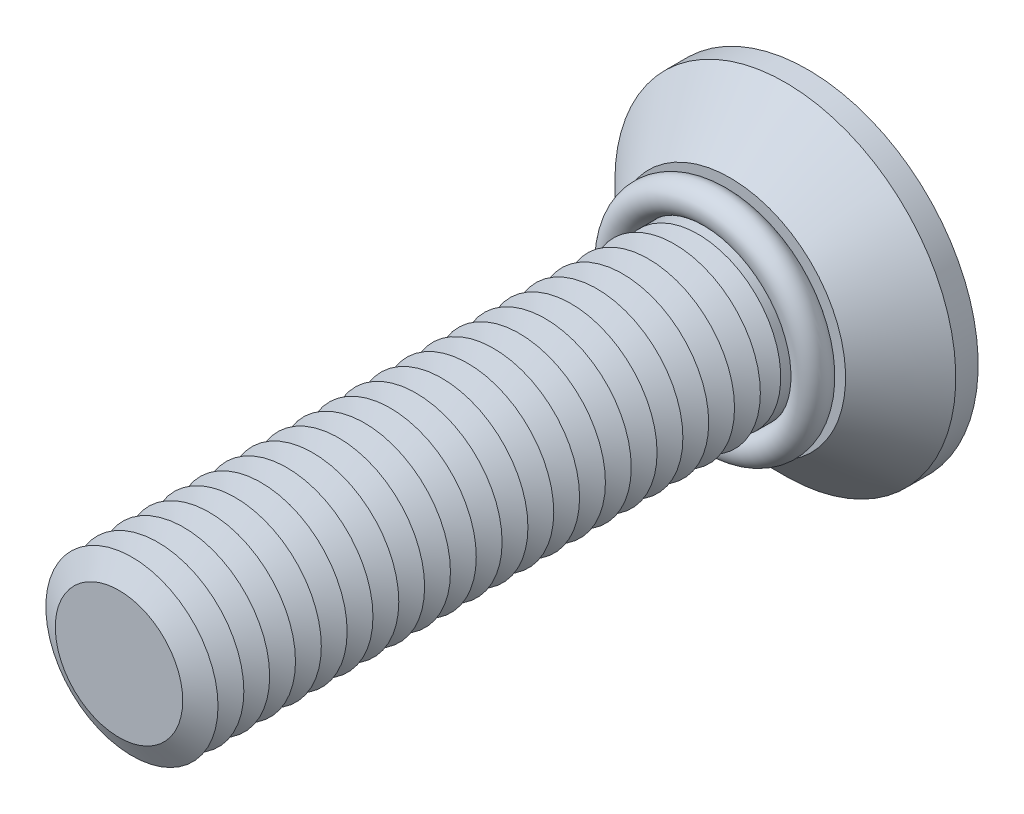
ISO-10303-21;
HEADER;
FILE_DESCRIPTION(('STEP AP214'),'2;1');
FILE_NAME('part.step','',(''),(''),'','','');
FILE_SCHEMA(('AUTOMOTIVE_DESIGN { 1 0 10303 214 1 1 1 1 }'));
ENDSEC;
DATA;
#1=APPLICATION_CONTEXT('core data for automotive mechanical design processes');
#2=APPLICATION_PROTOCOL_DEFINITION('international standard','automotive_design',2000,#1);
#3=PRODUCT_CONTEXT('',#1,'mechanical');
#4=PRODUCT('Part','Part','',(#3));
#5=PRODUCT_RELATED_PRODUCT_CATEGORY('part','',(#4));
#6=PRODUCT_DEFINITION_FORMATION('','',#4);
#7=PRODUCT_DEFINITION_CONTEXT('part definition',#1,'design');
#8=PRODUCT_DEFINITION('design','',#6,#7);
#9=PRODUCT_DEFINITION_SHAPE('','',#8);
#10=(LENGTH_UNIT() NAMED_UNIT(*) SI_UNIT(.MILLI.,.METRE.));
#11=(NAMED_UNIT(*) PLANE_ANGLE_UNIT() SI_UNIT($,.RADIAN.));
#12=(NAMED_UNIT(*) SI_UNIT($,.STERADIAN.) SOLID_ANGLE_UNIT());
#13=UNCERTAINTY_MEASURE_WITH_UNIT(LENGTH_MEASURE(1.E-05),#10,'distance_accuracy_value','');
#14=(GEOMETRIC_REPRESENTATION_CONTEXT(3) GLOBAL_UNCERTAINTY_ASSIGNED_CONTEXT((#13)) GLOBAL_UNIT_ASSIGNED_CONTEXT((#10,
#11,#12)) REPRESENTATION_CONTEXT('',''));
#15=CARTESIAN_POINT('',(0.,0.,0.));
#16=DIRECTION('',(0.,0.,1.));
#17=DIRECTION('',(1.,0.,0.));
#18=AXIS2_PLACEMENT_3D('',#15,#16,#17);
#19=CARTESIAN_POINT('',(0.,0.,5.39999999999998));
#20=DIRECTION('',(0.,0.,1.));
#21=DIRECTION('',(1.,0.,0.));
#22=AXIS2_PLACEMENT_3D('',#19,#20,#21);
#23=TOROIDAL_SURFACE('',#22,5.7,0.9);
#24=CARTESIAN_POINT('',(0.,5.7,5.39999999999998));
#25=DIRECTION('',(1.,0.,0.));
#26=DIRECTION('',(0.,0.,-1.));
#27=AXIS2_PLACEMENT_3D('',#24,#25,#26);
#28=CIRCLE('',#27,0.9);
#29=CARTESIAN_POINT('',(0.,6.6,5.39999999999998));
#30=VERTEX_POINT('',#29);
#31=EDGE_CURVE('P0_E10',#30,#30,#28,.T.);
#32=CARTESIAN_POINT('',(0.,0.,5.39999999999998));
#33=DIRECTION('',(0.,0.,1.));
#34=DIRECTION('',(1.,0.,0.));
#35=AXIS2_PLACEMENT_3D('',#32,#33,#34);
#36=CIRCLE('',#35,6.6);
#37=EDGE_CURVE('',#30,#30,#36,.T.);
#38=ORIENTED_EDGE('',*,*,#31,.F.);
#39=ORIENTED_EDGE('',*,*,#31,.T.);
#40=ORIENTED_EDGE('',*,*,#37,.T.);
#41=ORIENTED_EDGE('',*,*,#37,.F.);
#42=EDGE_LOOP('',(#38,#40,#39,#41));
#43=FACE_BOUND('',#42,.T.);
#44=ADVANCED_FACE('P0_F14',(#43),#23,.T.);
#45=CLOSED_SHELL('',(#44));
#46=MANIFOLD_SOLID_BREP('P0_B1',#45);
#47=CARTESIAN_POINT('',(0.,0.,32.5));
#48=DIRECTION('',(0.,0.,-1.));
#49=DIRECTION('',(-1.,0.,0.));
#50=AXIS2_PLACEMENT_3D('',#47,#48,#49);
#51=CONICAL_SURFACE('',#50,3.70096189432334,1.0471975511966);
#52=CARTESIAN_POINT('',(0.,0.,31.75));
#53=DIRECTION('',(0.,0.,1.));
#54=DIRECTION('',(1.,0.,0.));
#55=AXIS2_PLACEMENT_3D('',#52,#53,#54);
#56=CIRCLE('',#55,5.);
#57=CARTESIAN_POINT('',(5.,0.,31.75));
#58=VERTEX_POINT('',#57);
#59=EDGE_CURVE('P1_E324',#58,#58,#56,.T.);
#60=ORIENTED_EDGE('',*,*,#59,.T.);
#61=EDGE_LOOP('',(#60));
#62=FACE_BOUND('',#61,.T.);
#63=CARTESIAN_POINT('',(0.,0.,32.5));
#64=DIRECTION('',(0.,0.,1.));
#65=DIRECTION('',(1.,0.,0.));
#66=AXIS2_PLACEMENT_3D('',#63,#64,#65);
#67=CIRCLE('',#66,3.70096189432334);
#68=CARTESIAN_POINT('',(3.70096189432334,0.,32.5));
#69=VERTEX_POINT('',#68);
#70=EDGE_CURVE('P1_E321',#69,#69,#67,.T.);
#71=ORIENTED_EDGE('',*,*,#70,.F.);
#72=EDGE_LOOP('',(#71));
#73=FACE_BOUND('',#72,.T.);
#74=ADVANCED_FACE('P1_F15',(#62,#73),#51,.T.);
#75=CARTESIAN_POINT('',(0.,0.,33.25));
#76=DIRECTION('',(0.,0.,1.));
#77=DIRECTION('',(1.,0.,0.));
#78=AXIS2_PLACEMENT_3D('',#75,#76,#77);
#79=CONICAL_SURFACE('',#78,5.,1.0471975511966);
#80=ORIENTED_EDGE('',*,*,#70,.T.);
#81=EDGE_LOOP('',(#80));
#82=FACE_BOUND('',#81,.T.);
#83=CARTESIAN_POINT('',(0.,0.,33.25));
#84=DIRECTION('',(0.,0.,1.));
#85=DIRECTION('',(1.,0.,0.));
#86=AXIS2_PLACEMENT_3D('',#83,#84,#85);
#87=CIRCLE('',#86,5.);
#88=CARTESIAN_POINT('',(5.,0.,33.25));
#89=VERTEX_POINT('',#88);
#90=EDGE_CURVE('P1_E318',#89,#89,#87,.T.);
#91=ORIENTED_EDGE('',*,*,#90,.F.);
#92=EDGE_LOOP('',(#91));
#93=FACE_BOUND('',#92,.T.);
#94=ADVANCED_FACE('P1_F245',(#82,#93),#79,.T.);
#95=CARTESIAN_POINT('',(0.,0.,40.));
#96=DIRECTION('',(0.,0.,1.));
#97=DIRECTION('',(1.,0.,0.));
#98=AXIS2_PLACEMENT_3D('',#95,#96,#97);
#99=PLANE('',#98);
#100=CARTESIAN_POINT('',(0.,0.,40.));
#101=DIRECTION('',(0.,0.,1.));
#102=DIRECTION('',(1.,0.,0.));
#103=AXIS2_PLACEMENT_3D('',#100,#101,#102);
#104=CIRCLE('',#103,3.70096189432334);
#105=CARTESIAN_POINT('',(3.70096189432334,0.,40.));
#106=VERTEX_POINT('',#105);
#107=EDGE_CURVE('P1_E131',#106,#106,#104,.T.);
#108=ORIENTED_EDGE('',*,*,#107,.T.);
#109=EDGE_LOOP('',(#108));
#110=FACE_BOUND('',#109,.T.);
#111=ADVANCED_FACE('P1_F251',(#110),#99,.T.);
#112=CARTESIAN_POINT('',(0.,0.,40.));
#113=DIRECTION('',(0.,0.,-1.));
#114=DIRECTION('',(-1.,0.,0.));
#115=AXIS2_PLACEMENT_3D('',#112,#113,#114);
#116=CONICAL_SURFACE('',#115,3.70096189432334,1.0471975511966);
#117=CARTESIAN_POINT('',(0.,0.,39.25));
#118=DIRECTION('',(0.,0.,1.));
#119=DIRECTION('',(1.,0.,0.));
#120=AXIS2_PLACEMENT_3D('',#117,#118,#119);
#121=CIRCLE('',#120,5.);
#122=CARTESIAN_POINT('',(5.,0.,39.25));
#123=VERTEX_POINT('',#122);
#124=EDGE_CURVE('P1_E133',#123,#123,#121,.T.);
#125=ORIENTED_EDGE('',*,*,#124,.T.);
#126=EDGE_LOOP('',(#125));
#127=FACE_BOUND('',#126,.T.);
#128=ORIENTED_EDGE('',*,*,#107,.F.);
#129=EDGE_LOOP('',(#128));
#130=FACE_BOUND('',#129,.T.);
#131=ADVANCED_FACE('P1_F196',(#127,#130),#116,.T.);
#132=CARTESIAN_POINT('',(0.,0.,39.25));
#133=DIRECTION('',(0.,0.,1.));
#134=DIRECTION('',(1.,0.,0.));
#135=AXIS2_PLACEMENT_3D('',#132,#133,#134);
#136=CONICAL_SURFACE('',#135,5.,1.0471975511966);
#137=CARTESIAN_POINT('',(0.,0.,38.5));
#138=DIRECTION('',(0.,0.,1.));
#139=DIRECTION('',(1.,0.,0.));
#140=AXIS2_PLACEMENT_3D('',#137,#138,#139);
#141=CIRCLE('',#140,3.70096189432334);
#142=CARTESIAN_POINT('',(3.70096189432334,0.,38.5));
#143=VERTEX_POINT('',#142);
#144=EDGE_CURVE('P1_E297',#143,#143,#141,.T.);
#145=ORIENTED_EDGE('',*,*,#144,.T.);
#146=EDGE_LOOP('',(#145));
#147=FACE_BOUND('',#146,.T.);
#148=ORIENTED_EDGE('',*,*,#124,.F.);
#149=EDGE_LOOP('',(#148));
#150=FACE_BOUND('',#149,.T.);
#151=ADVANCED_FACE('P1_F284',(#147,#150),#136,.T.);
#152=CARTESIAN_POINT('',(0.,0.,38.5));
#153=DIRECTION('',(0.,0.,-1.));
#154=DIRECTION('',(-1.,0.,0.));
#155=AXIS2_PLACEMENT_3D('',#152,#153,#154);
#156=CONICAL_SURFACE('',#155,3.70096189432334,1.0471975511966);
#157=CARTESIAN_POINT('',(0.,0.,37.75));
#158=DIRECTION('',(0.,0.,1.));
#159=DIRECTION('',(1.,0.,0.));
#160=AXIS2_PLACEMENT_3D('',#157,#158,#159);
#161=CIRCLE('',#160,5.);
#162=CARTESIAN_POINT('',(5.,0.,37.75));
#163=VERTEX_POINT('',#162);
#164=EDGE_CURVE('P1_E294',#163,#163,#161,.T.);
#165=ORIENTED_EDGE('',*,*,#164,.T.);
#166=EDGE_LOOP('',(#165));
#167=FACE_BOUND('',#166,.T.);
#168=ORIENTED_EDGE('',*,*,#144,.F.);
#169=EDGE_LOOP('',(#168));
#170=FACE_BOUND('',#169,.T.);
#171=ADVANCED_FACE('P1_F279',(#167,#170),#156,.T.);
#172=CARTESIAN_POINT('',(0.,0.,37.75));
#173=DIRECTION('',(0.,0.,1.));
#174=DIRECTION('',(1.,0.,0.));
#175=AXIS2_PLACEMENT_3D('',#172,#173,#174);
#176=CONICAL_SURFACE('',#175,5.,1.0471975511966);
#177=CARTESIAN_POINT('',(0.,0.,37.));
#178=DIRECTION('',(0.,0.,1.));
#179=DIRECTION('',(1.,0.,0.));
#180=AXIS2_PLACEMENT_3D('',#177,#178,#179);
#181=CIRCLE('',#180,3.70096189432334);
#182=CARTESIAN_POINT('',(3.70096189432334,0.,37.));
#183=VERTEX_POINT('',#182);
#184=EDGE_CURVE('P1_E301',#183,#183,#181,.T.);
#185=ORIENTED_EDGE('',*,*,#184,.T.);
#186=EDGE_LOOP('',(#185));
#187=FACE_BOUND('',#186,.T.);
#188=ORIENTED_EDGE('',*,*,#164,.F.);
#189=EDGE_LOOP('',(#188));
#190=FACE_BOUND('',#189,.T.);
#191=ADVANCED_FACE('P1_F276',(#187,#190),#176,.T.);
#192=CARTESIAN_POINT('',(0.,0.,37.));
#193=DIRECTION('',(0.,0.,-1.));
#194=DIRECTION('',(-1.,0.,0.));
#195=AXIS2_PLACEMENT_3D('',#192,#193,#194);
#196=CONICAL_SURFACE('',#195,3.70096189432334,1.0471975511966);
#197=CARTESIAN_POINT('',(0.,0.,36.25));
#198=DIRECTION('',(0.,0.,1.));
#199=DIRECTION('',(1.,0.,0.));
#200=AXIS2_PLACEMENT_3D('',#197,#198,#199);
#201=CIRCLE('',#200,5.);
#202=CARTESIAN_POINT('',(5.,0.,36.25));
#203=VERTEX_POINT('',#202);
#204=EDGE_CURVE('P1_E306',#203,#203,#201,.T.);
#205=ORIENTED_EDGE('',*,*,#204,.T.);
#206=EDGE_LOOP('',(#205));
#207=FACE_BOUND('',#206,.T.);
#208=ORIENTED_EDGE('',*,*,#184,.F.);
#209=EDGE_LOOP('',(#208));
#210=FACE_BOUND('',#209,.T.);
#211=ADVANCED_FACE('P1_F271',(#207,#210),#196,.T.);
#212=CARTESIAN_POINT('',(0.,0.,36.25));
#213=DIRECTION('',(0.,0.,1.));
#214=DIRECTION('',(1.,0.,0.));
#215=AXIS2_PLACEMENT_3D('',#212,#213,#214);
#216=CONICAL_SURFACE('',#215,5.,1.0471975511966);
#217=CARTESIAN_POINT('',(0.,0.,35.5));
#218=DIRECTION('',(0.,0.,1.));
#219=DIRECTION('',(1.,0.,0.));
#220=AXIS2_PLACEMENT_3D('',#217,#218,#219);
#221=CIRCLE('',#220,3.70096189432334);
#222=CARTESIAN_POINT('',(3.70096189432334,0.,35.5));
#223=VERTEX_POINT('',#222);
#224=EDGE_CURVE('P1_E309',#223,#223,#221,.T.);
#225=ORIENTED_EDGE('',*,*,#224,.T.);
#226=EDGE_LOOP('',(#225));
#227=FACE_BOUND('',#226,.T.);
#228=ORIENTED_EDGE('',*,*,#204,.F.);
#229=EDGE_LOOP('',(#228));
#230=FACE_BOUND('',#229,.T.);
#231=ADVANCED_FACE('P1_F268',(#227,#230),#216,.T.);
#232=CARTESIAN_POINT('',(0.,0.,35.5));
#233=DIRECTION('',(0.,0.,-1.));
#234=DIRECTION('',(-1.,0.,0.));
#235=AXIS2_PLACEMENT_3D('',#232,#233,#234);
#236=CONICAL_SURFACE('',#235,3.70096189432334,1.0471975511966);
#237=CARTESIAN_POINT('',(0.,0.,34.75));
#238=DIRECTION('',(0.,0.,1.));
#239=DIRECTION('',(1.,0.,0.));
#240=AXIS2_PLACEMENT_3D('',#237,#238,#239);
#241=CIRCLE('',#240,5.);
#242=CARTESIAN_POINT('',(5.,0.,34.75));
#243=VERTEX_POINT('',#242);
#244=EDGE_CURVE('P1_E312',#243,#243,#241,.T.);
#245=ORIENTED_EDGE('',*,*,#244,.T.);
#246=EDGE_LOOP('',(#245));
#247=FACE_BOUND('',#246,.T.);
#248=ORIENTED_EDGE('',*,*,#224,.F.);
#249=EDGE_LOOP('',(#248));
#250=FACE_BOUND('',#249,.T.);
#251=ADVANCED_FACE('P1_F262',(#247,#250),#236,.T.);
#252=CARTESIAN_POINT('',(0.,0.,34.75));
#253=DIRECTION('',(0.,0.,1.));
#254=DIRECTION('',(1.,0.,0.));
#255=AXIS2_PLACEMENT_3D('',#252,#253,#254);
#256=CONICAL_SURFACE('',#255,5.,1.0471975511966);
#257=CARTESIAN_POINT('',(0.,0.,34.));
#258=DIRECTION('',(0.,0.,1.));
#259=DIRECTION('',(1.,0.,0.));
#260=AXIS2_PLACEMENT_3D('',#257,#258,#259);
#261=CIRCLE('',#260,3.70096189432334);
#262=CARTESIAN_POINT('',(3.70096189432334,0.,34.));
#263=VERTEX_POINT('',#262);
#264=EDGE_CURVE('P1_E315',#263,#263,#261,.T.);
#265=ORIENTED_EDGE('',*,*,#264,.T.);
#266=EDGE_LOOP('',(#265));
#267=FACE_BOUND('',#266,.T.);
#268=ORIENTED_EDGE('',*,*,#244,.F.);
#269=EDGE_LOOP('',(#268));
#270=FACE_BOUND('',#269,.T.);
#271=ADVANCED_FACE('P1_F258',(#267,#270),#256,.T.);
#272=CARTESIAN_POINT('',(0.,0.,34.));
#273=DIRECTION('',(0.,0.,-1.));
#274=DIRECTION('',(-1.,0.,0.));
#275=AXIS2_PLACEMENT_3D('',#272,#273,#274);
#276=CONICAL_SURFACE('',#275,3.70096189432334,1.0471975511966);
#277=ORIENTED_EDGE('',*,*,#90,.T.);
#278=EDGE_LOOP('',(#277));
#279=FACE_BOUND('',#278,.T.);
#280=ORIENTED_EDGE('',*,*,#264,.F.);
#281=EDGE_LOOP('',(#280));
#282=FACE_BOUND('',#281,.T.);
#283=ADVANCED_FACE('P1_F261',(#279,#282),#276,.T.);
#284=CARTESIAN_POINT('',(0.,0.,31.));
#285=DIRECTION('',(0.,0.,-1.));
#286=DIRECTION('',(-1.,0.,0.));
#287=AXIS2_PLACEMENT_3D('',#284,#285,#286);
#288=CONICAL_SURFACE('',#287,3.70096189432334,1.0471975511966);
#289=CARTESIAN_POINT('',(0.,0.,30.25));
#290=DIRECTION('',(0.,0.,1.));
#291=DIRECTION('',(1.,0.,0.));
#292=AXIS2_PLACEMENT_3D('',#289,#290,#291);
#293=CIRCLE('',#292,5.);
#294=CARTESIAN_POINT('',(5.,0.,30.25));
#295=VERTEX_POINT('',#294);
#296=EDGE_CURVE('P1_E329',#295,#295,#293,.T.);
#297=ORIENTED_EDGE('',*,*,#296,.T.);
#298=EDGE_LOOP('',(#297));
#299=FACE_BOUND('',#298,.T.);
#300=CARTESIAN_POINT('',(0.,0.,31.));
#301=DIRECTION('',(0.,0.,1.));
#302=DIRECTION('',(1.,0.,0.));
#303=AXIS2_PLACEMENT_3D('',#300,#301,#302);
#304=CIRCLE('',#303,3.70096189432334);
#305=CARTESIAN_POINT('',(3.70096189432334,0.,31.));
#306=VERTEX_POINT('',#305);
#307=EDGE_CURVE('P1_E326',#306,#306,#304,.T.);
#308=ORIENTED_EDGE('',*,*,#307,.F.);
#309=EDGE_LOOP('',(#308));
#310=FACE_BOUND('',#309,.T.);
#311=ADVANCED_FACE('P1_F266',(#299,#310),#288,.T.);
#312=CARTESIAN_POINT('',(0.,0.,31.75));
#313=DIRECTION('',(0.,0.,1.));
#314=DIRECTION('',(1.,0.,0.));
#315=AXIS2_PLACEMENT_3D('',#312,#313,#314);
#316=CONICAL_SURFACE('',#315,5.,1.0471975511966);
#317=ORIENTED_EDGE('',*,*,#307,.T.);
#318=EDGE_LOOP('',(#317));
#319=FACE_BOUND('',#318,.T.);
#320=ORIENTED_EDGE('',*,*,#59,.F.);
#321=EDGE_LOOP('',(#320));
#322=FACE_BOUND('',#321,.T.);
#323=ADVANCED_FACE('P1_F527',(#319,#322),#316,.T.);
#324=CARTESIAN_POINT('',(0.,0.,29.5));
#325=DIRECTION('',(0.,0.,-1.));
#326=DIRECTION('',(-1.,0.,0.));
#327=AXIS2_PLACEMENT_3D('',#324,#325,#326);
#328=CONICAL_SURFACE('',#327,3.70096189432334,1.0471975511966);
#329=CARTESIAN_POINT('',(0.,0.,28.75));
#330=DIRECTION('',(0.,0.,1.));
#331=DIRECTION('',(1.,0.,0.));
#332=AXIS2_PLACEMENT_3D('',#329,#330,#331);
#333=CIRCLE('',#332,5.);
#334=CARTESIAN_POINT('',(5.,0.,28.75));
#335=VERTEX_POINT('',#334);
#336=EDGE_CURVE('P1_E335',#335,#335,#333,.T.);
#337=ORIENTED_EDGE('',*,*,#336,.T.);
#338=EDGE_LOOP('',(#337));
#339=FACE_BOUND('',#338,.T.);
#340=CARTESIAN_POINT('',(0.,0.,29.5));
#341=DIRECTION('',(0.,0.,1.));
#342=DIRECTION('',(1.,0.,0.));
#343=AXIS2_PLACEMENT_3D('',#340,#341,#342);
#344=CIRCLE('',#343,3.70096189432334);
#345=CARTESIAN_POINT('',(3.70096189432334,0.,29.5));
#346=VERTEX_POINT('',#345);
#347=EDGE_CURVE('P1_E332',#346,#346,#344,.T.);
#348=ORIENTED_EDGE('',*,*,#347,.F.);
#349=EDGE_LOOP('',(#348));
#350=FACE_BOUND('',#349,.T.);
#351=ADVANCED_FACE('P1_F536',(#339,#350),#328,.T.);
#352=CARTESIAN_POINT('',(0.,0.,30.25));
#353=DIRECTION('',(0.,0.,1.));
#354=DIRECTION('',(1.,0.,0.));
#355=AXIS2_PLACEMENT_3D('',#352,#353,#354);
#356=CONICAL_SURFACE('',#355,5.,1.0471975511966);
#357=ORIENTED_EDGE('',*,*,#347,.T.);
#358=EDGE_LOOP('',(#357));
#359=FACE_BOUND('',#358,.T.);
#360=ORIENTED_EDGE('',*,*,#296,.F.);
#361=EDGE_LOOP('',(#360));
#362=FACE_BOUND('',#361,.T.);
#363=ADVANCED_FACE('P1_F546',(#359,#362),#356,.T.);
#364=CARTESIAN_POINT('',(0.,0.,28.));
#365=DIRECTION('',(0.,0.,-1.));
#366=DIRECTION('',(-1.,0.,0.));
#367=AXIS2_PLACEMENT_3D('',#364,#365,#366);
#368=CONICAL_SURFACE('',#367,3.70096189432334,1.0471975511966);
#369=CARTESIAN_POINT('',(0.,0.,27.25));
#370=DIRECTION('',(0.,0.,1.));
#371=DIRECTION('',(1.,0.,0.));
#372=AXIS2_PLACEMENT_3D('',#369,#370,#371);
#373=CIRCLE('',#372,5.);
#374=CARTESIAN_POINT('',(5.,0.,27.25));
#375=VERTEX_POINT('',#374);
#376=EDGE_CURVE('P1_E341',#375,#375,#373,.T.);
#377=ORIENTED_EDGE('',*,*,#376,.T.);
#378=EDGE_LOOP('',(#377));
#379=FACE_BOUND('',#378,.T.);
#380=CARTESIAN_POINT('',(0.,0.,28.));
#381=DIRECTION('',(0.,0.,1.));
#382=DIRECTION('',(1.,0.,0.));
#383=AXIS2_PLACEMENT_3D('',#380,#381,#382);
#384=CIRCLE('',#383,3.70096189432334);
#385=CARTESIAN_POINT('',(3.70096189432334,0.,28.));
#386=VERTEX_POINT('',#385);
#387=EDGE_CURVE('P1_E338',#386,#386,#384,.T.);
#388=ORIENTED_EDGE('',*,*,#387,.F.);
#389=EDGE_LOOP('',(#388));
#390=FACE_BOUND('',#389,.T.);
#391=ADVANCED_FACE('P1_F556',(#379,#390),#368,.T.);
#392=CARTESIAN_POINT('',(0.,0.,28.75));
#393=DIRECTION('',(0.,0.,1.));
#394=DIRECTION('',(1.,0.,0.));
#395=AXIS2_PLACEMENT_3D('',#392,#393,#394);
#396=CONICAL_SURFACE('',#395,5.,1.0471975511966);
#397=ORIENTED_EDGE('',*,*,#387,.T.);
#398=EDGE_LOOP('',(#397));
#399=FACE_BOUND('',#398,.T.);
#400=ORIENTED_EDGE('',*,*,#336,.F.);
#401=EDGE_LOOP('',(#400));
#402=FACE_BOUND('',#401,.T.);
#403=ADVANCED_FACE('P1_F566',(#399,#402),#396,.T.);
#404=CARTESIAN_POINT('',(0.,0.,26.5));
#405=DIRECTION('',(0.,0.,-1.));
#406=DIRECTION('',(-1.,0.,0.));
#407=AXIS2_PLACEMENT_3D('',#404,#405,#406);
#408=CONICAL_SURFACE('',#407,3.70096189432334,1.0471975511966);
#409=CARTESIAN_POINT('',(0.,0.,25.75));
#410=DIRECTION('',(0.,0.,1.));
#411=DIRECTION('',(1.,0.,0.));
#412=AXIS2_PLACEMENT_3D('',#409,#410,#411);
#413=CIRCLE('',#412,5.);
#414=CARTESIAN_POINT('',(5.,0.,25.75));
#415=VERTEX_POINT('',#414);
#416=EDGE_CURVE('P1_E347',#415,#415,#413,.T.);
#417=ORIENTED_EDGE('',*,*,#416,.T.);
#418=EDGE_LOOP('',(#417));
#419=FACE_BOUND('',#418,.T.);
#420=CARTESIAN_POINT('',(0.,0.,26.5));
#421=DIRECTION('',(0.,0.,1.));
#422=DIRECTION('',(1.,0.,0.));
#423=AXIS2_PLACEMENT_3D('',#420,#421,#422);
#424=CIRCLE('',#423,3.70096189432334);
#425=CARTESIAN_POINT('',(3.70096189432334,0.,26.5));
#426=VERTEX_POINT('',#425);
#427=EDGE_CURVE('P1_E344',#426,#426,#424,.T.);
#428=ORIENTED_EDGE('',*,*,#427,.F.);
#429=EDGE_LOOP('',(#428));
#430=FACE_BOUND('',#429,.T.);
#431=ADVANCED_FACE('P1_F576',(#419,#430),#408,.T.);
#432=CARTESIAN_POINT('',(0.,0.,27.25));
#433=DIRECTION('',(0.,0.,1.));
#434=DIRECTION('',(1.,0.,0.));
#435=AXIS2_PLACEMENT_3D('',#432,#433,#434);
#436=CONICAL_SURFACE('',#435,5.,1.0471975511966);
#437=ORIENTED_EDGE('',*,*,#427,.T.);
#438=EDGE_LOOP('',(#437));
#439=FACE_BOUND('',#438,.T.);
#440=ORIENTED_EDGE('',*,*,#376,.F.);
#441=EDGE_LOOP('',(#440));
#442=FACE_BOUND('',#441,.T.);
#443=ADVANCED_FACE('P1_F586',(#439,#442),#436,.T.);
#444=CARTESIAN_POINT('',(0.,0.,25.));
#445=DIRECTION('',(0.,0.,-1.));
#446=DIRECTION('',(-1.,0.,0.));
#447=AXIS2_PLACEMENT_3D('',#444,#445,#446);
#448=CONICAL_SURFACE('',#447,3.70096189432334,1.0471975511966);
#449=CARTESIAN_POINT('',(0.,0.,24.25));
#450=DIRECTION('',(0.,0.,1.));
#451=DIRECTION('',(1.,0.,0.));
#452=AXIS2_PLACEMENT_3D('',#449,#450,#451);
#453=CIRCLE('',#452,5.);
#454=CARTESIAN_POINT('',(5.,0.,24.25));
#455=VERTEX_POINT('',#454);
#456=EDGE_CURVE('P1_E353',#455,#455,#453,.T.);
#457=ORIENTED_EDGE('',*,*,#456,.T.);
#458=EDGE_LOOP('',(#457));
#459=FACE_BOUND('',#458,.T.);
#460=CARTESIAN_POINT('',(0.,0.,25.));
#461=DIRECTION('',(0.,0.,1.));
#462=DIRECTION('',(1.,0.,0.));
#463=AXIS2_PLACEMENT_3D('',#460,#461,#462);
#464=CIRCLE('',#463,3.70096189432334);
#465=CARTESIAN_POINT('',(3.70096189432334,0.,25.));
#466=VERTEX_POINT('',#465);
#467=EDGE_CURVE('P1_E350',#466,#466,#464,.T.);
#468=ORIENTED_EDGE('',*,*,#467,.F.);
#469=EDGE_LOOP('',(#468));
#470=FACE_BOUND('',#469,.T.);
#471=ADVANCED_FACE('P1_F596',(#459,#470),#448,.T.);
#472=CARTESIAN_POINT('',(0.,0.,25.75));
#473=DIRECTION('',(0.,0.,1.));
#474=DIRECTION('',(1.,0.,0.));
#475=AXIS2_PLACEMENT_3D('',#472,#473,#474);
#476=CONICAL_SURFACE('',#475,5.,1.0471975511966);
#477=ORIENTED_EDGE('',*,*,#467,.T.);
#478=EDGE_LOOP('',(#477));
#479=FACE_BOUND('',#478,.T.);
#480=ORIENTED_EDGE('',*,*,#416,.F.);
#481=EDGE_LOOP('',(#480));
#482=FACE_BOUND('',#481,.T.);
#483=ADVANCED_FACE('P1_F606',(#479,#482),#476,.T.);
#484=CARTESIAN_POINT('',(0.,0.,23.5));
#485=DIRECTION('',(0.,0.,-1.));
#486=DIRECTION('',(-1.,0.,0.));
#487=AXIS2_PLACEMENT_3D('',#484,#485,#486);
#488=CONICAL_SURFACE('',#487,3.70096189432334,1.0471975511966);
#489=CARTESIAN_POINT('',(0.,0.,22.75));
#490=DIRECTION('',(0.,0.,1.));
#491=DIRECTION('',(1.,0.,0.));
#492=AXIS2_PLACEMENT_3D('',#489,#490,#491);
#493=CIRCLE('',#492,5.);
#494=CARTESIAN_POINT('',(5.,0.,22.75));
#495=VERTEX_POINT('',#494);
#496=EDGE_CURVE('P1_E359',#495,#495,#493,.T.);
#497=ORIENTED_EDGE('',*,*,#496,.T.);
#498=EDGE_LOOP('',(#497));
#499=FACE_BOUND('',#498,.T.);
#500=CARTESIAN_POINT('',(0.,0.,23.5));
#501=DIRECTION('',(0.,0.,1.));
#502=DIRECTION('',(1.,0.,0.));
#503=AXIS2_PLACEMENT_3D('',#500,#501,#502);
#504=CIRCLE('',#503,3.70096189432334);
#505=CARTESIAN_POINT('',(3.70096189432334,0.,23.5));
#506=VERTEX_POINT('',#505);
#507=EDGE_CURVE('P1_E356',#506,#506,#504,.T.);
#508=ORIENTED_EDGE('',*,*,#507,.F.);
#509=EDGE_LOOP('',(#508));
#510=FACE_BOUND('',#509,.T.);
#511=ADVANCED_FACE('P1_F616',(#499,#510),#488,.T.);
#512=CARTESIAN_POINT('',(0.,0.,24.25));
#513=DIRECTION('',(0.,0.,1.));
#514=DIRECTION('',(1.,0.,0.));
#515=AXIS2_PLACEMENT_3D('',#512,#513,#514);
#516=CONICAL_SURFACE('',#515,5.,1.0471975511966);
#517=ORIENTED_EDGE('',*,*,#507,.T.);
#518=EDGE_LOOP('',(#517));
#519=FACE_BOUND('',#518,.T.);
#520=ORIENTED_EDGE('',*,*,#456,.F.);
#521=EDGE_LOOP('',(#520));
#522=FACE_BOUND('',#521,.T.);
#523=ADVANCED_FACE('P1_F626',(#519,#522),#516,.T.);
#524=CARTESIAN_POINT('',(0.,0.,22.));
#525=DIRECTION('',(0.,0.,-1.));
#526=DIRECTION('',(-1.,0.,0.));
#527=AXIS2_PLACEMENT_3D('',#524,#525,#526);
#528=CONICAL_SURFACE('',#527,3.70096189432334,1.0471975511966);
#529=CARTESIAN_POINT('',(0.,0.,21.25));
#530=DIRECTION('',(0.,0.,1.));
#531=DIRECTION('',(1.,0.,0.));
#532=AXIS2_PLACEMENT_3D('',#529,#530,#531);
#533=CIRCLE('',#532,5.);
#534=CARTESIAN_POINT('',(5.,0.,21.25));
#535=VERTEX_POINT('',#534);
#536=EDGE_CURVE('P1_E365',#535,#535,#533,.T.);
#537=ORIENTED_EDGE('',*,*,#536,.T.);
#538=EDGE_LOOP('',(#537));
#539=FACE_BOUND('',#538,.T.);
#540=CARTESIAN_POINT('',(0.,0.,22.));
#541=DIRECTION('',(0.,0.,1.));
#542=DIRECTION('',(1.,0.,0.));
#543=AXIS2_PLACEMENT_3D('',#540,#541,#542);
#544=CIRCLE('',#543,3.70096189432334);
#545=CARTESIAN_POINT('',(3.70096189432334,0.,22.));
#546=VERTEX_POINT('',#545);
#547=EDGE_CURVE('P1_E362',#546,#546,#544,.T.);
#548=ORIENTED_EDGE('',*,*,#547,.F.);
#549=EDGE_LOOP('',(#548));
#550=FACE_BOUND('',#549,.T.);
#551=ADVANCED_FACE('P1_F636',(#539,#550),#528,.T.);
#552=CARTESIAN_POINT('',(0.,0.,22.75));
#553=DIRECTION('',(0.,0.,1.));
#554=DIRECTION('',(1.,0.,0.));
#555=AXIS2_PLACEMENT_3D('',#552,#553,#554);
#556=CONICAL_SURFACE('',#555,5.,1.0471975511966);
#557=ORIENTED_EDGE('',*,*,#547,.T.);
#558=EDGE_LOOP('',(#557));
#559=FACE_BOUND('',#558,.T.);
#560=ORIENTED_EDGE('',*,*,#496,.F.);
#561=EDGE_LOOP('',(#560));
#562=FACE_BOUND('',#561,.T.);
#563=ADVANCED_FACE('P1_F646',(#559,#562),#556,.T.);
#564=CARTESIAN_POINT('',(0.,0.,20.5));
#565=DIRECTION('',(0.,0.,-1.));
#566=DIRECTION('',(-1.,0.,0.));
#567=AXIS2_PLACEMENT_3D('',#564,#565,#566);
#568=CONICAL_SURFACE('',#567,3.70096189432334,1.0471975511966);
#569=CARTESIAN_POINT('',(0.,0.,19.75));
#570=DIRECTION('',(0.,0.,1.));
#571=DIRECTION('',(1.,0.,0.));
#572=AXIS2_PLACEMENT_3D('',#569,#570,#571);
#573=CIRCLE('',#572,5.);
#574=CARTESIAN_POINT('',(5.,0.,19.75));
#575=VERTEX_POINT('',#574);
#576=EDGE_CURVE('P1_E371',#575,#575,#573,.T.);
#577=ORIENTED_EDGE('',*,*,#576,.T.);
#578=EDGE_LOOP('',(#577));
#579=FACE_BOUND('',#578,.T.);
#580=CARTESIAN_POINT('',(0.,0.,20.5));
#581=DIRECTION('',(0.,0.,1.));
#582=DIRECTION('',(1.,0.,0.));
#583=AXIS2_PLACEMENT_3D('',#580,#581,#582);
#584=CIRCLE('',#583,3.70096189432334);
#585=CARTESIAN_POINT('',(3.70096189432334,0.,20.5));
#586=VERTEX_POINT('',#585);
#587=EDGE_CURVE('P1_E368',#586,#586,#584,.T.);
#588=ORIENTED_EDGE('',*,*,#587,.F.);
#589=EDGE_LOOP('',(#588));
#590=FACE_BOUND('',#589,.T.);
#591=ADVANCED_FACE('P1_F656',(#579,#590),#568,.T.);
#592=CARTESIAN_POINT('',(0.,0.,21.25));
#593=DIRECTION('',(0.,0.,1.));
#594=DIRECTION('',(1.,0.,0.));
#595=AXIS2_PLACEMENT_3D('',#592,#593,#594);
#596=CONICAL_SURFACE('',#595,5.,1.0471975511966);
#597=ORIENTED_EDGE('',*,*,#587,.T.);
#598=EDGE_LOOP('',(#597));
#599=FACE_BOUND('',#598,.T.);
#600=ORIENTED_EDGE('',*,*,#536,.F.);
#601=EDGE_LOOP('',(#600));
#602=FACE_BOUND('',#601,.T.);
#603=ADVANCED_FACE('P1_F666',(#599,#602),#596,.T.);
#604=CARTESIAN_POINT('',(0.,0.,19.));
#605=DIRECTION('',(0.,0.,-1.));
#606=DIRECTION('',(-1.,0.,0.));
#607=AXIS2_PLACEMENT_3D('',#604,#605,#606);
#608=CONICAL_SURFACE('',#607,3.70096189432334,1.0471975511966);
#609=CARTESIAN_POINT('',(0.,0.,18.25));
#610=DIRECTION('',(0.,0.,1.));
#611=DIRECTION('',(1.,0.,0.));
#612=AXIS2_PLACEMENT_3D('',#609,#610,#611);
#613=CIRCLE('',#612,5.);
#614=CARTESIAN_POINT('',(5.,0.,18.25));
#615=VERTEX_POINT('',#614);
#616=EDGE_CURVE('P1_E377',#615,#615,#613,.T.);
#617=ORIENTED_EDGE('',*,*,#616,.T.);
#618=EDGE_LOOP('',(#617));
#619=FACE_BOUND('',#618,.T.);
#620=CARTESIAN_POINT('',(0.,0.,19.));
#621=DIRECTION('',(0.,0.,1.));
#622=DIRECTION('',(1.,0.,0.));
#623=AXIS2_PLACEMENT_3D('',#620,#621,#622);
#624=CIRCLE('',#623,3.70096189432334);
#625=CARTESIAN_POINT('',(3.70096189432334,0.,19.));
#626=VERTEX_POINT('',#625);
#627=EDGE_CURVE('P1_E374',#626,#626,#624,.T.);
#628=ORIENTED_EDGE('',*,*,#627,.F.);
#629=EDGE_LOOP('',(#628));
#630=FACE_BOUND('',#629,.T.);
#631=ADVANCED_FACE('P1_F676',(#619,#630),#608,.T.);
#632=CARTESIAN_POINT('',(0.,0.,19.75));
#633=DIRECTION('',(0.,0.,1.));
#634=DIRECTION('',(1.,0.,0.));
#635=AXIS2_PLACEMENT_3D('',#632,#633,#634);
#636=CONICAL_SURFACE('',#635,5.,1.0471975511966);
#637=ORIENTED_EDGE('',*,*,#627,.T.);
#638=EDGE_LOOP('',(#637));
#639=FACE_BOUND('',#638,.T.);
#640=ORIENTED_EDGE('',*,*,#576,.F.);
#641=EDGE_LOOP('',(#640));
#642=FACE_BOUND('',#641,.T.);
#643=ADVANCED_FACE('P1_F686',(#639,#642),#636,.T.);
#644=CARTESIAN_POINT('',(0.,0.,17.5));
#645=DIRECTION('',(0.,0.,-1.));
#646=DIRECTION('',(-1.,0.,0.));
#647=AXIS2_PLACEMENT_3D('',#644,#645,#646);
#648=CONICAL_SURFACE('',#647,3.70096189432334,1.0471975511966);
#649=CARTESIAN_POINT('',(0.,0.,16.75));
#650=DIRECTION('',(0.,0.,1.));
#651=DIRECTION('',(1.,0.,0.));
#652=AXIS2_PLACEMENT_3D('',#649,#650,#651);
#653=CIRCLE('',#652,5.);
#654=CARTESIAN_POINT('',(5.,0.,16.75));
#655=VERTEX_POINT('',#654);
#656=EDGE_CURVE('P1_E383',#655,#655,#653,.T.);
#657=ORIENTED_EDGE('',*,*,#656,.T.);
#658=EDGE_LOOP('',(#657));
#659=FACE_BOUND('',#658,.T.);
#660=CARTESIAN_POINT('',(0.,0.,17.5));
#661=DIRECTION('',(0.,0.,1.));
#662=DIRECTION('',(1.,0.,0.));
#663=AXIS2_PLACEMENT_3D('',#660,#661,#662);
#664=CIRCLE('',#663,3.70096189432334);
#665=CARTESIAN_POINT('',(3.70096189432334,0.,17.5));
#666=VERTEX_POINT('',#665);
#667=EDGE_CURVE('P1_E380',#666,#666,#664,.T.);
#668=ORIENTED_EDGE('',*,*,#667,.F.);
#669=EDGE_LOOP('',(#668));
#670=FACE_BOUND('',#669,.T.);
#671=ADVANCED_FACE('P1_F696',(#659,#670),#648,.T.);
#672=CARTESIAN_POINT('',(0.,0.,18.25));
#673=DIRECTION('',(0.,0.,1.));
#674=DIRECTION('',(1.,0.,0.));
#675=AXIS2_PLACEMENT_3D('',#672,#673,#674);
#676=CONICAL_SURFACE('',#675,5.,1.0471975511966);
#677=ORIENTED_EDGE('',*,*,#667,.T.);
#678=EDGE_LOOP('',(#677));
#679=FACE_BOUND('',#678,.T.);
#680=ORIENTED_EDGE('',*,*,#616,.F.);
#681=EDGE_LOOP('',(#680));
#682=FACE_BOUND('',#681,.T.);
#683=ADVANCED_FACE('P1_F706',(#679,#682),#676,.T.);
#684=CARTESIAN_POINT('',(0.,0.,16.));
#685=DIRECTION('',(0.,0.,-1.));
#686=DIRECTION('',(-1.,0.,0.));
#687=AXIS2_PLACEMENT_3D('',#684,#685,#686);
#688=CONICAL_SURFACE('',#687,3.70096189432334,1.0471975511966);
#689=CARTESIAN_POINT('',(0.,0.,15.25));
#690=DIRECTION('',(0.,0.,1.));
#691=DIRECTION('',(1.,0.,0.));
#692=AXIS2_PLACEMENT_3D('',#689,#690,#691);
#693=CIRCLE('',#692,5.);
#694=CARTESIAN_POINT('',(5.,0.,15.25));
#695=VERTEX_POINT('',#694);
#696=EDGE_CURVE('P1_E389',#695,#695,#693,.T.);
#697=ORIENTED_EDGE('',*,*,#696,.T.);
#698=EDGE_LOOP('',(#697));
#699=FACE_BOUND('',#698,.T.);
#700=CARTESIAN_POINT('',(0.,0.,16.));
#701=DIRECTION('',(0.,0.,1.));
#702=DIRECTION('',(1.,0.,0.));
#703=AXIS2_PLACEMENT_3D('',#700,#701,#702);
#704=CIRCLE('',#703,3.70096189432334);
#705=CARTESIAN_POINT('',(3.70096189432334,0.,16.));
#706=VERTEX_POINT('',#705);
#707=EDGE_CURVE('P1_E386',#706,#706,#704,.T.);
#708=ORIENTED_EDGE('',*,*,#707,.F.);
#709=EDGE_LOOP('',(#708));
#710=FACE_BOUND('',#709,.T.);
#711=ADVANCED_FACE('P1_F716',(#699,#710),#688,.T.);
#712=CARTESIAN_POINT('',(0.,0.,16.75));
#713=DIRECTION('',(0.,0.,1.));
#714=DIRECTION('',(1.,0.,0.));
#715=AXIS2_PLACEMENT_3D('',#712,#713,#714);
#716=CONICAL_SURFACE('',#715,5.,1.0471975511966);
#717=ORIENTED_EDGE('',*,*,#707,.T.);
#718=EDGE_LOOP('',(#717));
#719=FACE_BOUND('',#718,.T.);
#720=ORIENTED_EDGE('',*,*,#656,.F.);
#721=EDGE_LOOP('',(#720));
#722=FACE_BOUND('',#721,.T.);
#723=ADVANCED_FACE('P1_F726',(#719,#722),#716,.T.);
#724=CARTESIAN_POINT('',(0.,0.,14.5));
#725=DIRECTION('',(0.,0.,-1.));
#726=DIRECTION('',(-1.,0.,0.));
#727=AXIS2_PLACEMENT_3D('',#724,#725,#726);
#728=CONICAL_SURFACE('',#727,3.70096189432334,1.0471975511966);
#729=CARTESIAN_POINT('',(0.,0.,13.75));
#730=DIRECTION('',(0.,0.,1.));
#731=DIRECTION('',(1.,0.,0.));
#732=AXIS2_PLACEMENT_3D('',#729,#730,#731);
#733=CIRCLE('',#732,5.);
#734=CARTESIAN_POINT('',(5.,0.,13.75));
#735=VERTEX_POINT('',#734);
#736=EDGE_CURVE('P1_E395',#735,#735,#733,.T.);
#737=ORIENTED_EDGE('',*,*,#736,.T.);
#738=EDGE_LOOP('',(#737));
#739=FACE_BOUND('',#738,.T.);
#740=CARTESIAN_POINT('',(0.,0.,14.5));
#741=DIRECTION('',(0.,0.,1.));
#742=DIRECTION('',(1.,0.,0.));
#743=AXIS2_PLACEMENT_3D('',#740,#741,#742);
#744=CIRCLE('',#743,3.70096189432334);
#745=CARTESIAN_POINT('',(3.70096189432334,0.,14.5));
#746=VERTEX_POINT('',#745);
#747=EDGE_CURVE('P1_E392',#746,#746,#744,.T.);
#748=ORIENTED_EDGE('',*,*,#747,.F.);
#749=EDGE_LOOP('',(#748));
#750=FACE_BOUND('',#749,.T.);
#751=ADVANCED_FACE('P1_F736',(#739,#750),#728,.T.);
#752=CARTESIAN_POINT('',(0.,0.,15.25));
#753=DIRECTION('',(0.,0.,1.));
#754=DIRECTION('',(1.,0.,0.));
#755=AXIS2_PLACEMENT_3D('',#752,#753,#754);
#756=CONICAL_SURFACE('',#755,5.,1.0471975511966);
#757=ORIENTED_EDGE('',*,*,#747,.T.);
#758=EDGE_LOOP('',(#757));
#759=FACE_BOUND('',#758,.T.);
#760=ORIENTED_EDGE('',*,*,#696,.F.);
#761=EDGE_LOOP('',(#760));
#762=FACE_BOUND('',#761,.T.);
#763=ADVANCED_FACE('P1_F746',(#759,#762),#756,.T.);
#764=CARTESIAN_POINT('',(0.,0.,13.));
#765=DIRECTION('',(0.,0.,-1.));
#766=DIRECTION('',(-1.,0.,0.));
#767=AXIS2_PLACEMENT_3D('',#764,#765,#766);
#768=CONICAL_SURFACE('',#767,3.70096189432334,1.0471975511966);
#769=CARTESIAN_POINT('',(0.,0.,12.25));
#770=DIRECTION('',(0.,0.,1.));
#771=DIRECTION('',(1.,0.,0.));
#772=AXIS2_PLACEMENT_3D('',#769,#770,#771);
#773=CIRCLE('',#772,5.);
#774=CARTESIAN_POINT('',(5.,0.,12.25));
#775=VERTEX_POINT('',#774);
#776=EDGE_CURVE('P1_E401',#775,#775,#773,.T.);
#777=ORIENTED_EDGE('',*,*,#776,.T.);
#778=EDGE_LOOP('',(#777));
#779=FACE_BOUND('',#778,.T.);
#780=CARTESIAN_POINT('',(0.,0.,13.));
#781=DIRECTION('',(0.,0.,1.));
#782=DIRECTION('',(1.,0.,0.));
#783=AXIS2_PLACEMENT_3D('',#780,#781,#782);
#784=CIRCLE('',#783,3.70096189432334);
#785=CARTESIAN_POINT('',(3.70096189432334,0.,13.));
#786=VERTEX_POINT('',#785);
#787=EDGE_CURVE('P1_E398',#786,#786,#784,.T.);
#788=ORIENTED_EDGE('',*,*,#787,.F.);
#789=EDGE_LOOP('',(#788));
#790=FACE_BOUND('',#789,.T.);
#791=ADVANCED_FACE('P1_F756',(#779,#790),#768,.T.);
#792=CARTESIAN_POINT('',(0.,0.,13.75));
#793=DIRECTION('',(0.,0.,1.));
#794=DIRECTION('',(1.,0.,0.));
#795=AXIS2_PLACEMENT_3D('',#792,#793,#794);
#796=CONICAL_SURFACE('',#795,5.,1.0471975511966);
#797=ORIENTED_EDGE('',*,*,#787,.T.);
#798=EDGE_LOOP('',(#797));
#799=FACE_BOUND('',#798,.T.);
#800=ORIENTED_EDGE('',*,*,#736,.F.);
#801=EDGE_LOOP('',(#800));
#802=FACE_BOUND('',#801,.T.);
#803=ADVANCED_FACE('P1_F766',(#799,#802),#796,.T.);
#804=CARTESIAN_POINT('',(0.,0.,11.5));
#805=DIRECTION('',(0.,0.,-1.));
#806=DIRECTION('',(-1.,0.,0.));
#807=AXIS2_PLACEMENT_3D('',#804,#805,#806);
#808=CONICAL_SURFACE('',#807,3.70096189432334,1.0471975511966);
#809=CARTESIAN_POINT('',(0.,0.,10.75));
#810=DIRECTION('',(0.,0.,1.));
#811=DIRECTION('',(1.,0.,0.));
#812=AXIS2_PLACEMENT_3D('',#809,#810,#811);
#813=CIRCLE('',#812,5.);
#814=CARTESIAN_POINT('',(5.,0.,10.75));
#815=VERTEX_POINT('',#814);
#816=EDGE_CURVE('P1_E407',#815,#815,#813,.T.);
#817=ORIENTED_EDGE('',*,*,#816,.T.);
#818=EDGE_LOOP('',(#817));
#819=FACE_BOUND('',#818,.T.);
#820=CARTESIAN_POINT('',(0.,0.,11.5));
#821=DIRECTION('',(0.,0.,1.));
#822=DIRECTION('',(1.,0.,0.));
#823=AXIS2_PLACEMENT_3D('',#820,#821,#822);
#824=CIRCLE('',#823,3.70096189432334);
#825=CARTESIAN_POINT('',(3.70096189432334,0.,11.5));
#826=VERTEX_POINT('',#825);
#827=EDGE_CURVE('P1_E404',#826,#826,#824,.T.);
#828=ORIENTED_EDGE('',*,*,#827,.F.);
#829=EDGE_LOOP('',(#828));
#830=FACE_BOUND('',#829,.T.);
#831=ADVANCED_FACE('P1_F776',(#819,#830),#808,.T.);
#832=CARTESIAN_POINT('',(0.,0.,12.25));
#833=DIRECTION('',(0.,0.,1.));
#834=DIRECTION('',(1.,0.,0.));
#835=AXIS2_PLACEMENT_3D('',#832,#833,#834);
#836=CONICAL_SURFACE('',#835,5.,1.0471975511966);
#837=ORIENTED_EDGE('',*,*,#827,.T.);
#838=EDGE_LOOP('',(#837));
#839=FACE_BOUND('',#838,.T.);
#840=ORIENTED_EDGE('',*,*,#776,.F.);
#841=EDGE_LOOP('',(#840));
#842=FACE_BOUND('',#841,.T.);
#843=ADVANCED_FACE('P1_F786',(#839,#842),#836,.T.);
#844=CARTESIAN_POINT('',(0.,0.,10.));
#845=DIRECTION('',(0.,0.,-1.));
#846=DIRECTION('',(-1.,0.,0.));
#847=AXIS2_PLACEMENT_3D('',#844,#845,#846);
#848=CONICAL_SURFACE('',#847,3.70096189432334,1.0471975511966);
#849=CARTESIAN_POINT('',(0.,0.,9.25));
#850=DIRECTION('',(0.,0.,1.));
#851=DIRECTION('',(1.,0.,0.));
#852=AXIS2_PLACEMENT_3D('',#849,#850,#851);
#853=CIRCLE('',#852,5.);
#854=CARTESIAN_POINT('',(5.,0.,9.25));
#855=VERTEX_POINT('',#854);
#856=EDGE_CURVE('P1_E413',#855,#855,#853,.T.);
#857=ORIENTED_EDGE('',*,*,#856,.T.);
#858=EDGE_LOOP('',(#857));
#859=FACE_BOUND('',#858,.T.);
#860=CARTESIAN_POINT('',(0.,0.,10.));
#861=DIRECTION('',(0.,0.,1.));
#862=DIRECTION('',(1.,0.,0.));
#863=AXIS2_PLACEMENT_3D('',#860,#861,#862);
#864=CIRCLE('',#863,3.70096189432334);
#865=CARTESIAN_POINT('',(3.70096189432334,0.,10.));
#866=VERTEX_POINT('',#865);
#867=EDGE_CURVE('P1_E410',#866,#866,#864,.T.);
#868=ORIENTED_EDGE('',*,*,#867,.F.);
#869=EDGE_LOOP('',(#868));
#870=FACE_BOUND('',#869,.T.);
#871=ADVANCED_FACE('P1_F796',(#859,#870),#848,.T.);
#872=CARTESIAN_POINT('',(0.,0.,10.75));
#873=DIRECTION('',(0.,0.,1.));
#874=DIRECTION('',(1.,0.,0.));
#875=AXIS2_PLACEMENT_3D('',#872,#873,#874);
#876=CONICAL_SURFACE('',#875,5.,1.0471975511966);
#877=ORIENTED_EDGE('',*,*,#867,.T.);
#878=EDGE_LOOP('',(#877));
#879=FACE_BOUND('',#878,.T.);
#880=ORIENTED_EDGE('',*,*,#816,.F.);
#881=EDGE_LOOP('',(#880));
#882=FACE_BOUND('',#881,.T.);
#883=ADVANCED_FACE('P1_F806',(#879,#882),#876,.T.);
#884=CARTESIAN_POINT('',(0.,0.,8.5));
#885=DIRECTION('',(0.,0.,-1.));
#886=DIRECTION('',(-1.,0.,0.));
#887=AXIS2_PLACEMENT_3D('',#884,#885,#886);
#888=CONICAL_SURFACE('',#887,3.70096189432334,1.0471975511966);
#889=CARTESIAN_POINT('',(0.,0.,7.75));
#890=DIRECTION('',(0.,0.,1.));
#891=DIRECTION('',(1.,0.,0.));
#892=AXIS2_PLACEMENT_3D('',#889,#890,#891);
#893=CIRCLE('',#892,5.);
#894=CARTESIAN_POINT('',(5.,0.,7.75));
#895=VERTEX_POINT('',#894);
#896=EDGE_CURVE('P1_E419',#895,#895,#893,.T.);
#897=ORIENTED_EDGE('',*,*,#896,.T.);
#898=EDGE_LOOP('',(#897));
#899=FACE_BOUND('',#898,.T.);
#900=CARTESIAN_POINT('',(0.,0.,8.5));
#901=DIRECTION('',(0.,0.,1.));
#902=DIRECTION('',(1.,0.,0.));
#903=AXIS2_PLACEMENT_3D('',#900,#901,#902);
#904=CIRCLE('',#903,3.70096189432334);
#905=CARTESIAN_POINT('',(3.70096189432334,0.,8.5));
#906=VERTEX_POINT('',#905);
#907=EDGE_CURVE('P1_E416',#906,#906,#904,.T.);
#908=ORIENTED_EDGE('',*,*,#907,.F.);
#909=EDGE_LOOP('',(#908));
#910=FACE_BOUND('',#909,.T.);
#911=ADVANCED_FACE('P1_F816',(#899,#910),#888,.T.);
#912=CARTESIAN_POINT('',(0.,0.,9.25));
#913=DIRECTION('',(0.,0.,1.));
#914=DIRECTION('',(1.,0.,0.));
#915=AXIS2_PLACEMENT_3D('',#912,#913,#914);
#916=CONICAL_SURFACE('',#915,5.,1.0471975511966);
#917=ORIENTED_EDGE('',*,*,#907,.T.);
#918=EDGE_LOOP('',(#917));
#919=FACE_BOUND('',#918,.T.);
#920=ORIENTED_EDGE('',*,*,#856,.F.);
#921=EDGE_LOOP('',(#920));
#922=FACE_BOUND('',#921,.T.);
#923=ADVANCED_FACE('P1_F432',(#919,#922),#916,.T.);
#924=CARTESIAN_POINT('',(0.,0.,7.));
#925=DIRECTION('',(0.,0.,-1.));
#926=DIRECTION('',(-1.,0.,0.));
#927=AXIS2_PLACEMENT_3D('',#924,#925,#926);
#928=CONICAL_SURFACE('',#927,3.70096189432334,1.0471975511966);
#929=CARTESIAN_POINT('',(0.,0.,7.));
#930=DIRECTION('',(0.,0.,1.));
#931=DIRECTION('',(1.,0.,0.));
#932=AXIS2_PLACEMENT_3D('',#929,#930,#931);
#933=CIRCLE('',#932,3.70096189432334);
#934=CARTESIAN_POINT('',(3.70096189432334,0.,7.));
#935=VERTEX_POINT('',#934);
#936=EDGE_CURVE('P1_E422',#935,#935,#933,.T.);
#937=ORIENTED_EDGE('',*,*,#936,.F.);
#938=EDGE_LOOP('',(#937));
#939=FACE_BOUND('',#938,.T.);
#940=CARTESIAN_POINT('',(0.,0.,6.36547005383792));
#941=DIRECTION('',(0.,0.,-1.));
#942=DIRECTION('',(-1.,0.,0.));
#943=AXIS2_PLACEMENT_3D('',#940,#941,#942);
#944=CIRCLE('',#943,4.8);
#945=CARTESIAN_POINT('',(-4.8,0.,6.36547005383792));
#946=VERTEX_POINT('',#945);
#947=EDGE_CURVE('P1_E19',#946,#946,#944,.F.);
#948=ORIENTED_EDGE('',*,*,#947,.T.);
#949=EDGE_LOOP('',(#948));
#950=FACE_BOUND('',#949,.T.);
#951=ADVANCED_FACE('P1_F429',(#939,#950),#928,.T.);
#952=CARTESIAN_POINT('',(0.,0.,7.75));
#953=DIRECTION('',(0.,0.,1.));
#954=DIRECTION('',(1.,0.,0.));
#955=AXIS2_PLACEMENT_3D('',#952,#953,#954);
#956=CONICAL_SURFACE('',#955,5.,1.0471975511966);
#957=ORIENTED_EDGE('',*,*,#936,.T.);
#958=EDGE_LOOP('',(#957));
#959=FACE_BOUND('',#958,.T.);
#960=ORIENTED_EDGE('',*,*,#896,.F.);
#961=EDGE_LOOP('',(#960));
#962=FACE_BOUND('',#961,.T.);
#963=ADVANCED_FACE('P1_F426',(#959,#962),#956,.T.);
#964=CARTESIAN_POINT('',(0.,0.,4.));
#965=DIRECTION('',(0.,0.,-1.));
#966=DIRECTION('',(-1.,0.,0.));
#967=AXIS2_PLACEMENT_3D('',#964,#965,#966);
#968=CONICAL_SURFACE('',#967,3.,1.0471975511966);
#969=CARTESIAN_POINT('',(0.,0.,5.73205080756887));
#970=VERTEX_POINT('',#969);
#971=VERTEX_LOOP('',#970);
#972=FACE_BOUND('',#971,.T.);
#973=CARTESIAN_POINT('',(0.,0.,4.));
#974=DIRECTION('',(0.,0.,-1.));
#975=DIRECTION('',(-1.,0.,0.));
#976=AXIS2_PLACEMENT_3D('',#973,#974,#975);
#977=CIRCLE('',#976,3.);
#978=CARTESIAN_POINT('',(-3.,0.,4.));
#979=VERTEX_POINT('',#978);
#980=CARTESIAN_POINT('',(-1.5,2.59807621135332,4.));
#981=VERTEX_POINT('',#980);
#982=EDGE_CURVE('P1_E117',#979,#981,#977,.T.);
#983=ORIENTED_EDGE('',*,*,#982,.T.);
#984=CARTESIAN_POINT('',(0.,0.,4.));
#985=DIRECTION('',(0.,0.,-1.));
#986=DIRECTION('',(-1.,0.,0.));
#987=AXIS2_PLACEMENT_3D('',#984,#985,#986);
#988=CIRCLE('',#987,3.);
#989=CARTESIAN_POINT('',(1.5,2.59807621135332,4.));
#990=VERTEX_POINT('',#989);
#991=EDGE_CURVE('P1_E24',#981,#990,#988,.T.);
#992=ORIENTED_EDGE('',*,*,#991,.T.);
#993=CARTESIAN_POINT('',(3.,0.,4.));
#994=VERTEX_POINT('',#993);
#995=EDGE_CURVE('P1_E1051',#990,#994,#988,.T.);
#996=ORIENTED_EDGE('',*,*,#995,.T.);
#997=CARTESIAN_POINT('',(1.5,-2.59807621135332,4.));
#998=VERTEX_POINT('',#997);
#999=EDGE_CURVE('P1_E1044',#994,#998,#988,.T.);
#1000=ORIENTED_EDGE('',*,*,#999,.T.);
#1001=CARTESIAN_POINT('',(-1.5,-2.59807621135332,4.));
#1002=VERTEX_POINT('',#1001);
#1003=EDGE_CURVE('P1_E182',#998,#1002,#988,.T.);
#1004=ORIENTED_EDGE('',*,*,#1003,.T.);
#1005=EDGE_CURVE('P1_E179',#1002,#979,#988,.T.);
#1006=ORIENTED_EDGE('',*,*,#1005,.T.);
#1007=EDGE_LOOP('',(#983,#992,#996,#1000,#1004,#1006));
#1008=FACE_BOUND('',#1007,.T.);
#1009=ADVANCED_FACE('P1_F198',(#972,#1008),#968,.F.);
#1010=CARTESIAN_POINT('',(0.,0.,4.));
#1011=DIRECTION('',(0.,0.,-1.));
#1012=DIRECTION('',(-1.,0.,0.));
#1013=AXIS2_PLACEMENT_3D('',#1010,#1011,#1012);
#1014=PLANE('',#1013);
#1015=ORIENTED_EDGE('',*,*,#1003,.F.);
#1016=DIRECTION('',(-0.866025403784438,-0.5,0.));
#1017=VECTOR('',#1016,1.);
#1018=CARTESIAN_POINT('',(3.,-1.73205080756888,4.));
#1019=LINE('',#1018,#1017);
#1020=CARTESIAN_POINT('',(0.,-3.46410161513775,4.));
#1021=VERTEX_POINT('',#1020);
#1022=EDGE_CURVE('P1_E1060',#998,#1021,#1019,.T.);
#1023=ORIENTED_EDGE('',*,*,#1022,.T.);
#1024=DIRECTION('',(-0.866025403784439,0.5,0.));
#1025=VECTOR('',#1024,1.);
#1026=CARTESIAN_POINT('',(0.,-3.46410161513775,4.));
#1027=LINE('',#1026,#1025);
#1028=EDGE_CURVE('P1_E1067',#1021,#1002,#1027,.T.);
#1029=ORIENTED_EDGE('',*,*,#1028,.T.);
#1030=EDGE_LOOP('',(#1015,#1023,#1029));
#1031=FACE_BOUND('',#1030,.T.);
#1032=ADVANCED_FACE('P1_F858',(#1031),#1014,.T.);
#1033=ORIENTED_EDGE('',*,*,#1005,.F.);
#1034=CARTESIAN_POINT('',(-3.,-1.73205080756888,4.));
#1035=VERTEX_POINT('',#1034);
#1036=EDGE_CURVE('P1_E1070',#1002,#1035,#1027,.T.);
#1037=ORIENTED_EDGE('',*,*,#1036,.T.);
#1038=DIRECTION('',(0.,1.,0.));
#1039=VECTOR('',#1038,1.);
#1040=CARTESIAN_POINT('',(-3.,-1.73205080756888,4.));
#1041=LINE('',#1040,#1039);
#1042=EDGE_CURVE('P1_E123',#1035,#979,#1041,.T.);
#1043=ORIENTED_EDGE('',*,*,#1042,.T.);
#1044=EDGE_LOOP('',(#1033,#1037,#1043));
#1045=FACE_BOUND('',#1044,.T.);
#1046=ADVANCED_FACE('P1_F231',(#1045),#1014,.T.);
#1047=ORIENTED_EDGE('',*,*,#982,.F.);
#1048=CARTESIAN_POINT('',(-3.,1.73205080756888,4.));
#1049=VERTEX_POINT('',#1048);
#1050=EDGE_CURVE('P1_E1072',#979,#1049,#1041,.T.);
#1051=ORIENTED_EDGE('',*,*,#1050,.T.);
#1052=DIRECTION('',(0.866025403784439,0.5,0.));
#1053=VECTOR('',#1052,1.);
#1054=CARTESIAN_POINT('',(-3.,1.73205080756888,4.));
#1055=LINE('',#1054,#1053);
#1056=EDGE_CURVE('P1_E1075',#1049,#981,#1055,.T.);
#1057=ORIENTED_EDGE('',*,*,#1056,.T.);
#1058=EDGE_LOOP('',(#1047,#1051,#1057));
#1059=FACE_BOUND('',#1058,.T.);
#1060=ADVANCED_FACE('P1_F875',(#1059),#1014,.T.);
#1061=ORIENTED_EDGE('',*,*,#991,.F.);
#1062=CARTESIAN_POINT('',(0.,3.46410161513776,4.));
#1063=VERTEX_POINT('',#1062);
#1064=EDGE_CURVE('P1_E1074',#981,#1063,#1055,.T.);
#1065=ORIENTED_EDGE('',*,*,#1064,.T.);
#1066=DIRECTION('',(0.866025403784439,-0.5,0.));
#1067=VECTOR('',#1066,1.);
#1068=CARTESIAN_POINT('',(0.,3.46410161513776,4.));
#1069=LINE('',#1068,#1067);
#1070=EDGE_CURVE('P1_E161',#1063,#990,#1069,.T.);
#1071=ORIENTED_EDGE('',*,*,#1070,.T.);
#1072=EDGE_LOOP('',(#1061,#1065,#1071));
#1073=FACE_BOUND('',#1072,.T.);
#1074=ADVANCED_FACE('P1_F884',(#1073),#1014,.T.);
#1075=ORIENTED_EDGE('',*,*,#995,.F.);
#1076=CARTESIAN_POINT('',(3.,1.73205080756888,4.));
#1077=VERTEX_POINT('',#1076);
#1078=EDGE_CURVE('P1_E1059',#990,#1077,#1069,.T.);
#1079=ORIENTED_EDGE('',*,*,#1078,.T.);
#1080=DIRECTION('',(0.,-1.,0.));
#1081=VECTOR('',#1080,1.);
#1082=CARTESIAN_POINT('',(3.,1.73205080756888,4.));
#1083=LINE('',#1082,#1081);
#1084=EDGE_CURVE('P1_E1054',#1077,#994,#1083,.T.);
#1085=ORIENTED_EDGE('',*,*,#1084,.T.);
#1086=EDGE_LOOP('',(#1075,#1079,#1085));
#1087=FACE_BOUND('',#1086,.T.);
#1088=ADVANCED_FACE('P1_F893',(#1087),#1014,.T.);
#1089=ORIENTED_EDGE('',*,*,#999,.F.);
#1090=CARTESIAN_POINT('',(3.,-1.73205080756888,4.));
#1091=VERTEX_POINT('',#1090);
#1092=EDGE_CURVE('P1_E1046',#994,#1091,#1083,.T.);
#1093=ORIENTED_EDGE('',*,*,#1092,.T.);
#1094=EDGE_CURVE('P1_E125',#1091,#998,#1019,.T.);
#1095=ORIENTED_EDGE('',*,*,#1094,.T.);
#1096=EDGE_LOOP('',(#1089,#1093,#1095));
#1097=FACE_BOUND('',#1096,.T.);
#1098=ADVANCED_FACE('P1_F229',(#1097),#1014,.T.);
#1099=CARTESIAN_POINT('',(3.,-1.73205080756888,4.));
#1100=DIRECTION('',(0.5,-0.866025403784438,0.));
#1101=DIRECTION('',(0.866025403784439,0.5,0.));
#1102=AXIS2_PLACEMENT_3D('',#1099,#1100,#1101);
#1103=PLANE('',#1102);
#1104=DIRECTION('',(0.,0.,-1.));
#1105=VECTOR('',#1104,1.);
#1106=CARTESIAN_POINT('',(3.,-1.73205080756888,4.));
#1107=LINE('',#1106,#1105);
#1108=CARTESIAN_POINT('',(3.,-1.73205080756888,0.));
#1109=VERTEX_POINT('',#1108);
#1110=EDGE_CURVE('P1_E164',#1091,#1109,#1107,.T.);
#1111=ORIENTED_EDGE('',*,*,#1110,.T.);
#1112=CARTESIAN_POINT('',(3.0002,-1.73193533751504,-3.09416546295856E-05));
#1113=CARTESIAN_POINT('',(2.8756009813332,-1.80387261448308,0.0192538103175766));
#1114=CARTESIAN_POINT('',(2.75077603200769,-1.87594033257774,0.036761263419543));
#1115=CARTESIAN_POINT('',(2.50068525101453,-2.02033031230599,0.067520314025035));
#1116=CARTESIAN_POINT('',(2.37541926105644,-2.0926526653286,0.0807701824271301));
#1117=CARTESIAN_POINT('',(2.12520598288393,-2.23711336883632,0.102240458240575));
#1118=CARTESIAN_POINT('',(2.00026038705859,-2.30925074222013,0.110486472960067));
#1119=CARTESIAN_POINT('',(1.75020983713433,-2.45361749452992,0.121543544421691));
#1120=CARTESIAN_POINT('',(1.62510491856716,-2.52584685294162,0.12435565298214));
#1121=CARTESIAN_POINT('',(1.37489508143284,-2.67030556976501,0.12435565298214));
#1122=CARTESIAN_POINT('',(1.24979016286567,-2.74253492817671,0.121543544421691));
#1123=CARTESIAN_POINT('',(0.99973961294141,-2.8869016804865,0.110486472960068));
#1124=CARTESIAN_POINT('',(0.874794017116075,-2.95903905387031,0.102240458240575));
#1125=CARTESIAN_POINT('',(0.62458073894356,-3.10349975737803,0.0807701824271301));
#1126=CARTESIAN_POINT('',(0.499314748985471,-3.17582211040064,0.067520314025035));
#1127=CARTESIAN_POINT('',(0.249223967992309,-3.32021209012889,0.036761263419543));
#1128=CARTESIAN_POINT('',(0.124399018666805,-3.39227980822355,0.0192538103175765));
#1129=CARTESIAN_POINT('',(-0.000199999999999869,-3.46421708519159,-3.09416546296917E-05));
#1130=B_SPLINE_CURVE_WITH_KNOTS('',3,(#1112,#1113,#1114,#1115,#1116,#1117,#1118,#1119,#1120,
#1121,#1122,#1123,#1124,#1125,#1126,#1127,#1128,#1129),.UNSPECIFIED.,.F.,.F.,(4,2,2,2,2,2,2,2,
4),(0.,0.435506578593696,0.871189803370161,1.30462418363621,1.73797465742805,2.17132513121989,
2.60475951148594,3.0404427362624,3.4759493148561),.UNSPECIFIED.);
#1131=CARTESIAN_POINT('',(0.,-3.46410161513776,0.));
#1132=VERTEX_POINT('',#1131);
#1133=EDGE_CURVE('P1_E118',#1109,#1132,#1130,.T.);
#1134=ORIENTED_EDGE('',*,*,#1133,.T.);
#1135=DIRECTION('',(0.,0.,-1.));
#1136=VECTOR('',#1135,1.);
#1137=CARTESIAN_POINT('',(0.,-3.46410161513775,4.));
#1138=LINE('',#1137,#1136);
#1139=EDGE_CURVE('P1_E116',#1021,#1132,#1138,.T.);
#1140=ORIENTED_EDGE('',*,*,#1139,.F.);
#1141=ORIENTED_EDGE('',*,*,#1022,.F.);
#1142=ORIENTED_EDGE('',*,*,#1094,.F.);
#1143=EDGE_LOOP('',(#1111,#1134,#1140,#1141,#1142));
#1144=FACE_BOUND('',#1143,.T.);
#1145=ADVANCED_FACE('P1_F226',(#1144),#1103,.F.);
#1146=CARTESIAN_POINT('',(0.,-3.46410161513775,4.));
#1147=DIRECTION('',(-0.5,-0.866025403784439,0.));
#1148=DIRECTION('',(0.866025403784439,-0.5,0.));
#1149=AXIS2_PLACEMENT_3D('',#1146,#1147,#1148);
#1150=PLANE('',#1149);
#1151=ORIENTED_EDGE('',*,*,#1139,.T.);
#1152=CARTESIAN_POINT('',(0.000200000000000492,-3.46421708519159,-3.09416546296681E-05));
#1153=CARTESIAN_POINT('',(-0.124399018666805,-3.39227980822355,0.0192538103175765));
#1154=CARTESIAN_POINT('',(-0.249223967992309,-3.32021209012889,0.036761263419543));
#1155=CARTESIAN_POINT('',(-0.49931474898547,-3.17582211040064,0.0675203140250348));
#1156=CARTESIAN_POINT('',(-0.62458073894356,-3.10349975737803,0.08077018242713));
#1157=CARTESIAN_POINT('',(-0.874794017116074,-2.95903905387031,0.102240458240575));
#1158=CARTESIAN_POINT('',(-0.999739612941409,-2.8869016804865,0.110486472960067));
#1159=CARTESIAN_POINT('',(-1.24979016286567,-2.74253492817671,0.121543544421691));
#1160=CARTESIAN_POINT('',(-1.37489508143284,-2.67030556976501,0.12435565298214));
#1161=CARTESIAN_POINT('',(-1.62510491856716,-2.52584685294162,0.12435565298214));
#1162=CARTESIAN_POINT('',(-1.75020983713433,-2.45361749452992,0.12154354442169));
#1163=CARTESIAN_POINT('',(-2.00026038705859,-2.30925074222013,0.110486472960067));
#1164=CARTESIAN_POINT('',(-2.12520598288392,-2.23711336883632,0.102240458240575));
#1165=CARTESIAN_POINT('',(-2.37541926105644,-2.0926526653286,0.08077018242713));
#1166=CARTESIAN_POINT('',(-2.50068525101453,-2.02033031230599,0.0675203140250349));
#1167=CARTESIAN_POINT('',(-2.75077603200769,-1.87594033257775,0.036761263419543));
#1168=CARTESIAN_POINT('',(-2.87560098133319,-1.80387261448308,0.0192538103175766));
#1169=CARTESIAN_POINT('',(-3.0002,-1.73193533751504,-3.09416546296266E-05));
#1170=B_SPLINE_CURVE_WITH_KNOTS('',3,(#1152,#1153,#1154,#1155,#1156,#1157,#1158,#1159,#1160,
#1161,#1162,#1163,#1164,#1165,#1166,#1167,#1168,#1169),.UNSPECIFIED.,.F.,.F.,(4,2,2,2,2,2,2,2,
4),(0.,0.435506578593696,0.87118980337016,1.3046241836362,1.73797465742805,2.17132513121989,
2.60475951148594,3.0404427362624,3.4759493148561),.UNSPECIFIED.);
#1171=CARTESIAN_POINT('',(-3.,-1.73205080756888,0.));
#1172=VERTEX_POINT('',#1171);
#1173=EDGE_CURVE('P1_E94',#1132,#1172,#1170,.T.);
#1174=ORIENTED_EDGE('',*,*,#1173,.T.);
#1175=DIRECTION('',(0.,0.,-1.));
#1176=VECTOR('',#1175,1.);
#1177=CARTESIAN_POINT('',(-3.,-1.73205080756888,4.));
#1178=LINE('',#1177,#1176);
#1179=EDGE_CURVE('P1_E112',#1035,#1172,#1178,.T.);
#1180=ORIENTED_EDGE('',*,*,#1179,.F.);
#1181=ORIENTED_EDGE('',*,*,#1036,.F.);
#1182=ORIENTED_EDGE('',*,*,#1028,.F.);
#1183=EDGE_LOOP('',(#1151,#1174,#1180,#1181,#1182));
#1184=FACE_BOUND('',#1183,.T.);
#1185=ADVANCED_FACE('P1_F110',(#1184),#1150,.F.);
#1186=CARTESIAN_POINT('',(-3.,-1.73205080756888,4.));
#1187=DIRECTION('',(-1.,0.,0.));
#1188=DIRECTION('',(0.,-1.,0.));
#1189=AXIS2_PLACEMENT_3D('',#1186,#1187,#1188);
#1190=PLANE('',#1189);
#1191=ORIENTED_EDGE('',*,*,#1179,.T.);
#1192=CARTESIAN_POINT('',(-3.,-4.52161137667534,-0.525775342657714));
#1193=CARTESIAN_POINT('',(-3.,-4.38614690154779,-0.495537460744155));
#1194=CARTESIAN_POINT('',(-3.,-4.25059605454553,-0.465680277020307));
#1195=CARTESIAN_POINT('',(-3.,-3.97927914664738,-0.406931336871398));
#1196=CARTESIAN_POINT('',(-3.,-3.84351307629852,-0.378039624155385));
#1197=CARTESIAN_POINT('',(-3.,-3.57159492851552,-0.321399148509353));
#1198=CARTESIAN_POINT('',(-3.,-3.43544259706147,-0.293651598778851));
#1199=CARTESIAN_POINT('',(-3.,-3.16285056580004,-0.239614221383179));
#1200=CARTESIAN_POINT('',(-3.,-3.02641086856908,-0.213324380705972));
#1201=CARTESIAN_POINT('',(-3.,-2.61896324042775,-0.137569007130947));
#1202=CARTESIAN_POINT('',(-3.,-2.34745999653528,-0.090713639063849));
#1203=CARTESIAN_POINT('',(-3.,-1.80279754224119,-0.00770905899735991));
#1204=CARTESIAN_POINT('',(-3.,-1.52963867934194,0.0284423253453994));
#1205=CARTESIAN_POINT('',(-3.,-1.11712206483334,0.0711149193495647));
#1206=CARTESIAN_POINT('',(-3.,-0.978367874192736,0.0834493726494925));
#1207=CARTESIAN_POINT('',(-3.,-0.700531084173,0.103508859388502));
#1208=CARTESIAN_POINT('',(-3.,-0.561448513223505,0.11123427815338));
#1209=CARTESIAN_POINT('',(-3.,-0.283146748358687,0.121626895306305));
#1210=CARTESIAN_POINT('',(-3.,-0.143927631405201,0.124296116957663));
#1211=CARTESIAN_POINT('',(-3.,0.134513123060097,0.124413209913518));
#1212=CARTESIAN_POINT('',(-3.,0.273734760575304,0.121861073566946));
#1213=CARTESIAN_POINT('',(-3.,0.552556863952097,0.111676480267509));
#1214=CARTESIAN_POINT('',(-3.,0.692156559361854,0.104023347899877));
#1215=CARTESIAN_POINT('',(-3.,0.971024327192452,0.08406484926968));
#1216=CARTESIAN_POINT('',(-3.,1.11029238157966,0.071759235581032));
#1217=CARTESIAN_POINT('',(-3.,1.3884939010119,0.0431025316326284));
#1218=CARTESIAN_POINT('',(-3.,1.52742710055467,0.0267489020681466));
#1219=CARTESIAN_POINT('',(-3.,1.80484805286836,-0.00934194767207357));
#1220=CARTESIAN_POINT('',(-3.,1.94333580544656,-0.0290791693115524));
#1221=CARTESIAN_POINT('',(-3.,2.2235029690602,-0.0718742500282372));
#1222=CARTESIAN_POINT('',(-3.,2.36517107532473,-0.0950054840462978));
#1223=CARTESIAN_POINT('',(-3.,2.648104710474,-0.143617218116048));
#1224=CARTESIAN_POINT('',(-3.,2.78937022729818,-0.169097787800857));
#1225=CARTESIAN_POINT('',(-3.,3.21267286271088,-0.248342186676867));
#1226=CARTESIAN_POINT('',(-3.,3.49418463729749,-0.304903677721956));
#1227=CARTESIAN_POINT('',(-3.,4.05626646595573,-0.422827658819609));
#1228=CARTESIAN_POINT('',(-3.,4.33683622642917,-0.484191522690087));
#1229=CARTESIAN_POINT('',(-3.,4.89726247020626,-0.610112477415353));
#1230=CARTESIAN_POINT('',(-3.,5.17711893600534,-0.67466964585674));
#1231=CARTESIAN_POINT('',(-3.,5.73290235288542,-0.80517176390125));
#1232=CARTESIAN_POINT('',(-3.,6.00883557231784,-0.87109015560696));
#1233=CARTESIAN_POINT('',(-3.,6.56033924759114,-1.00445136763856));
#1234=CARTESIAN_POINT('',(-3.,6.83590969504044,-1.07189422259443));
#1235=CARTESIAN_POINT('',(-3.,7.38639195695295,-1.20779575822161));
#1236=CARTESIAN_POINT('',(-3.,7.66130415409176,-1.27625289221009));
#1237=CARTESIAN_POINT('',(-3.,8.21090603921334,-1.41401333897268));
#1238=CARTESIAN_POINT('',(-3.,8.48559573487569,-1.48331662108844));
#1239=CARTESIAN_POINT('',(-3.,8.76020986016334,-1.55291480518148));
#1240=B_SPLINE_CURVE_WITH_KNOTS('',3,(#1192,#1193,#1194,#1195,#1196,#1197,#1198,#1199,#1200,
#1201,#1202,#1203,#1204,#1205,#1206,#1207,#1208,#1209,#1210,#1211,#1212,#1213,#1214,#1215,#1216,
#1217,#1218,#1219,#1220,#1221,#1222,#1223,#1224,#1225,#1226,#1227,#1228,#1229,#1230,#1231,#1232,
#1233,#1234,#1235,#1236,#1237,#1238,#1239),.UNSPECIFIED.,.F.,.F.,(4,2,2,2,2,2,2,2,2,2,2,2,2,2,2,
2,2,2,2,2,2,2,2,4),(0.,0.416396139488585,0.832811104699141,1.24965681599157,1.66649880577,
2.49292514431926,3.31918364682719,3.73702338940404,4.1548281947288,4.57246577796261,
4.99010397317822,5.40944532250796,5.82880897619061,6.24843636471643,6.66806393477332,
7.09867155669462,7.52929194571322,8.39062817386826,9.25221171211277,10.1138161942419,
10.9649037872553,11.8160107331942,12.6659315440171,13.5158216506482),.UNSPECIFIED.);
#1241=CARTESIAN_POINT('',(-3.,1.73205080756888,0.));
#1242=VERTEX_POINT('',#1241);
#1243=EDGE_CURVE('P1_E10',#1172,#1242,#1240,.T.);
#1244=ORIENTED_EDGE('',*,*,#1243,.T.);
#1245=DIRECTION('',(0.,0.,-1.));
#1246=VECTOR('',#1245,1.);
#1247=CARTESIAN_POINT('',(-3.,1.73205080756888,4.));
#1248=LINE('',#1247,#1246);
#1249=EDGE_CURVE('P1_E124',#1049,#1242,#1248,.T.);
#1250=ORIENTED_EDGE('',*,*,#1249,.F.);
#1251=ORIENTED_EDGE('',*,*,#1050,.F.);
#1252=ORIENTED_EDGE('',*,*,#1042,.F.);
#1253=EDGE_LOOP('',(#1191,#1244,#1250,#1251,#1252));
#1254=FACE_BOUND('',#1253,.T.);
#1255=ADVANCED_FACE('P1_F120',(#1254),#1190,.F.);
#1256=CARTESIAN_POINT('',(-3.,1.73205080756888,4.));
#1257=DIRECTION('',(-0.5,0.866025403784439,0.));
#1258=DIRECTION('',(-0.866025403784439,-0.5,0.));
#1259=AXIS2_PLACEMENT_3D('',#1256,#1257,#1258);
#1260=PLANE('',#1259);
#1261=ORIENTED_EDGE('',*,*,#1249,.T.);
#1262=CARTESIAN_POINT('',(-3.0002,1.73193533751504,-3.09416546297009E-05));
#1263=CARTESIAN_POINT('',(-2.87560098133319,1.80387261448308,0.0192538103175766));
#1264=CARTESIAN_POINT('',(-2.75077603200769,1.87594033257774,0.036761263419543));
#1265=CARTESIAN_POINT('',(-2.50068525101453,2.02033031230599,0.0675203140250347));
#1266=CARTESIAN_POINT('',(-2.37541926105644,2.0926526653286,0.0807701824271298));
#1267=CARTESIAN_POINT('',(-2.12520598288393,2.23711336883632,0.102240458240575));
#1268=CARTESIAN_POINT('',(-2.00026038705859,2.30925074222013,0.110486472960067));
#1269=CARTESIAN_POINT('',(-1.75020983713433,2.45361749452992,0.12154354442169));
#1270=CARTESIAN_POINT('',(-1.62510491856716,2.52584685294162,0.124355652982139));
#1271=CARTESIAN_POINT('',(-1.37489508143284,2.67030556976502,0.124355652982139));
#1272=CARTESIAN_POINT('',(-1.24979016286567,2.74253492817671,0.12154354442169));
#1273=CARTESIAN_POINT('',(-0.999739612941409,2.8869016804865,0.110486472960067));
#1274=CARTESIAN_POINT('',(-0.874794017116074,2.95903905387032,0.102240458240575));
#1275=CARTESIAN_POINT('',(-0.62458073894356,3.10349975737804,0.0807701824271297));
#1276=CARTESIAN_POINT('',(-0.499314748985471,3.17582211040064,0.0675203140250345));
#1277=CARTESIAN_POINT('',(-0.249223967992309,3.32021209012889,0.0367612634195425));
#1278=CARTESIAN_POINT('',(-0.124399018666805,3.39227980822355,0.019253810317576));
#1279=CARTESIAN_POINT('',(0.000200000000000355,3.46421708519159,-3.09416546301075E-05));
#1280=B_SPLINE_CURVE_WITH_KNOTS('',3,(#1262,#1263,#1264,#1265,#1266,#1267,#1268,#1269,#1270,
#1271,#1272,#1273,#1274,#1275,#1276,#1277,#1278,#1279),.UNSPECIFIED.,.F.,.F.,(4,2,2,2,2,2,2,2,
4),(0.,0.435506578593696,0.87118980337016,1.3046241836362,1.73797465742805,2.17132513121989,
2.60475951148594,3.0404427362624,3.4759493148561),.UNSPECIFIED.);
#1281=CARTESIAN_POINT('',(0.,3.46410161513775,0.));
#1282=VERTEX_POINT('',#1281);
#1283=EDGE_CURVE('P1_E136',#1242,#1282,#1280,.T.);
#1284=ORIENTED_EDGE('',*,*,#1283,.T.);
#1285=DIRECTION('',(0.,0.,-1.));
#1286=VECTOR('',#1285,1.);
#1287=CARTESIAN_POINT('',(0.,3.46410161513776,4.));
#1288=LINE('',#1287,#1286);
#1289=EDGE_CURVE('P1_E155',#1063,#1282,#1288,.T.);
#1290=ORIENTED_EDGE('',*,*,#1289,.F.);
#1291=ORIENTED_EDGE('',*,*,#1064,.F.);
#1292=ORIENTED_EDGE('',*,*,#1056,.F.);
#1293=EDGE_LOOP('',(#1261,#1284,#1290,#1291,#1292));
#1294=FACE_BOUND('',#1293,.T.);
#1295=ADVANCED_FACE('P1_F153',(#1294),#1260,.F.);
#1296=CARTESIAN_POINT('',(0.,3.46410161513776,4.));
#1297=DIRECTION('',(0.5,0.866025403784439,0.));
#1298=DIRECTION('',(-0.866025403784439,0.5,0.));
#1299=AXIS2_PLACEMENT_3D('',#1296,#1297,#1298);
#1300=PLANE('',#1299);
#1301=ORIENTED_EDGE('',*,*,#1289,.T.);
#1302=CARTESIAN_POINT('',(-0.000199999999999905,3.46421708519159,-3.09416546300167E-05));
#1303=CARTESIAN_POINT('',(0.124399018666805,3.39227980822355,0.0192538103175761));
#1304=CARTESIAN_POINT('',(0.249223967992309,3.32021209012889,0.0367612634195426));
#1305=CARTESIAN_POINT('',(0.499314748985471,3.17582211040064,0.0675203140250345));
#1306=CARTESIAN_POINT('',(0.624580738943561,3.10349975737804,0.0807701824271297));
#1307=CARTESIAN_POINT('',(0.874794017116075,2.95903905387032,0.102240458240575));
#1308=CARTESIAN_POINT('',(0.99973961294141,2.8869016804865,0.110486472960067));
#1309=CARTESIAN_POINT('',(1.24979016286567,2.74253492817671,0.12154354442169));
#1310=CARTESIAN_POINT('',(1.37489508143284,2.67030556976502,0.124355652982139));
#1311=CARTESIAN_POINT('',(1.62510491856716,2.52584685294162,0.124355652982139));
#1312=CARTESIAN_POINT('',(1.75020983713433,2.45361749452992,0.12154354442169));
#1313=CARTESIAN_POINT('',(2.00026038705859,2.30925074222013,0.110486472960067));
#1314=CARTESIAN_POINT('',(2.12520598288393,2.23711336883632,0.102240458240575));
#1315=CARTESIAN_POINT('',(2.37541926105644,2.0926526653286,0.0807701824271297));
#1316=CARTESIAN_POINT('',(2.50068525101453,2.02033031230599,0.0675203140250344));
#1317=CARTESIAN_POINT('',(2.75077603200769,1.87594033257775,0.0367612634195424));
#1318=CARTESIAN_POINT('',(2.8756009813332,1.80387261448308,0.0192538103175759));
#1319=CARTESIAN_POINT('',(3.0002,1.73193533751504,-3.09416546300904E-05));
#1320=B_SPLINE_CURVE_WITH_KNOTS('',3,(#1302,#1303,#1304,#1305,#1306,#1307,#1308,#1309,#1310,
#1311,#1312,#1313,#1314,#1315,#1316,#1317,#1318,#1319),.UNSPECIFIED.,.F.,.F.,(4,2,2,2,2,2,2,2,
4),(0.,0.435506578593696,0.87118980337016,1.3046241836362,1.73797465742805,2.17132513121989,
2.60475951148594,3.0404427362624,3.4759493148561),.UNSPECIFIED.);
#1321=CARTESIAN_POINT('',(3.,1.73205080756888,0.));
#1322=VERTEX_POINT('',#1321);
#1323=EDGE_CURVE('P1_E141',#1282,#1322,#1320,.T.);
#1324=ORIENTED_EDGE('',*,*,#1323,.T.);
#1325=DIRECTION('',(0.,0.,-1.));
#1326=VECTOR('',#1325,1.);
#1327=CARTESIAN_POINT('',(3.,1.73205080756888,4.));
#1328=LINE('',#1327,#1326);
#1329=EDGE_CURVE('P1_E162',#1077,#1322,#1328,.T.);
#1330=ORIENTED_EDGE('',*,*,#1329,.F.);
#1331=ORIENTED_EDGE('',*,*,#1078,.F.);
#1332=ORIENTED_EDGE('',*,*,#1070,.F.);
#1333=EDGE_LOOP('',(#1301,#1324,#1330,#1331,#1332));
#1334=FACE_BOUND('',#1333,.T.);
#1335=ADVANCED_FACE('P1_F158',(#1334),#1300,.F.);
#1336=CARTESIAN_POINT('',(3.,1.73205080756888,4.));
#1337=DIRECTION('',(1.,0.,0.));
#1338=DIRECTION('',(0.,1.,0.));
#1339=AXIS2_PLACEMENT_3D('',#1336,#1337,#1338);
#1340=PLANE('',#1339);
#1341=ORIENTED_EDGE('',*,*,#1329,.T.);
#1342=CARTESIAN_POINT('',(3.,-4.52161137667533,-0.525775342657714));
#1343=CARTESIAN_POINT('',(3.,-4.38614690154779,-0.495537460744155));
#1344=CARTESIAN_POINT('',(3.,-4.25059605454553,-0.465680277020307));
#1345=CARTESIAN_POINT('',(3.,-3.97927914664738,-0.406931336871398));
#1346=CARTESIAN_POINT('',(3.,-3.84351307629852,-0.378039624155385));
#1347=CARTESIAN_POINT('',(3.,-3.57159492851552,-0.321399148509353));
#1348=CARTESIAN_POINT('',(3.,-3.43544259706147,-0.293651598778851));
#1349=CARTESIAN_POINT('',(3.,-3.16285056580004,-0.239614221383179));
#1350=CARTESIAN_POINT('',(3.,-3.02641086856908,-0.213324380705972));
#1351=CARTESIAN_POINT('',(3.,-2.61896324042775,-0.137569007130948));
#1352=CARTESIAN_POINT('',(3.,-2.34745999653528,-0.0907136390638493));
#1353=CARTESIAN_POINT('',(3.,-1.80279754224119,-0.00770905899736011));
#1354=CARTESIAN_POINT('',(3.,-1.52963867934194,0.0284423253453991));
#1355=CARTESIAN_POINT('',(3.,-1.11712206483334,0.0711149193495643));
#1356=CARTESIAN_POINT('',(3.,-0.978367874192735,0.0834493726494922));
#1357=CARTESIAN_POINT('',(3.,-0.700531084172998,0.103508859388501));
#1358=CARTESIAN_POINT('',(3.,-0.561448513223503,0.11123427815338));
#1359=CARTESIAN_POINT('',(3.,-0.283146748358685,0.121626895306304));
#1360=CARTESIAN_POINT('',(3.,-0.143927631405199,0.124296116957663));
#1361=CARTESIAN_POINT('',(3.,0.134513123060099,0.124413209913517));
#1362=CARTESIAN_POINT('',(3.,0.273734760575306,0.121861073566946));
#1363=CARTESIAN_POINT('',(3.,0.552556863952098,0.111676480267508));
#1364=CARTESIAN_POINT('',(3.,0.692156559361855,0.104023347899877));
#1365=CARTESIAN_POINT('',(3.,0.971024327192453,0.0840648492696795));
#1366=CARTESIAN_POINT('',(3.,1.11029238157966,0.0717592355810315));
#1367=CARTESIAN_POINT('',(3.,1.3884939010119,0.0431025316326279));
#1368=CARTESIAN_POINT('',(3.,1.52742710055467,0.026748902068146));
#1369=CARTESIAN_POINT('',(3.,1.80484805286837,-0.00934194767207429));
#1370=CARTESIAN_POINT('',(3.,1.94333580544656,-0.0290791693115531));
#1371=CARTESIAN_POINT('',(3.,2.2235029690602,-0.0718742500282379));
#1372=CARTESIAN_POINT('',(3.,2.36517107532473,-0.0950054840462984));
#1373=CARTESIAN_POINT('',(3.,2.648104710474,-0.143617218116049));
#1374=CARTESIAN_POINT('',(3.,2.78937022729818,-0.169097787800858));
#1375=CARTESIAN_POINT('',(3.,3.21267286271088,-0.248342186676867));
#1376=CARTESIAN_POINT('',(3.,3.4941846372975,-0.304903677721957));
#1377=CARTESIAN_POINT('',(3.,4.05626646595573,-0.422827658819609));
#1378=CARTESIAN_POINT('',(3.,4.33683622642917,-0.484191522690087));
#1379=CARTESIAN_POINT('',(3.,4.89726247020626,-0.610112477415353));
#1380=CARTESIAN_POINT('',(3.,5.17711893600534,-0.67466964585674));
#1381=CARTESIAN_POINT('',(3.,5.73290235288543,-0.805171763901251));
#1382=CARTESIAN_POINT('',(3.,6.00883557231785,-0.871090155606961));
#1383=CARTESIAN_POINT('',(3.,6.56033924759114,-1.00445136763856));
#1384=CARTESIAN_POINT('',(3.,6.83590969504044,-1.07189422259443));
#1385=CARTESIAN_POINT('',(3.,7.38639195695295,-1.20779575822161));
#1386=CARTESIAN_POINT('',(3.,7.66130415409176,-1.27625289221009));
#1387=CARTESIAN_POINT('',(3.,8.21090603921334,-1.41401333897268));
#1388=CARTESIAN_POINT('',(3.,8.48559573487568,-1.48331662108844));
#1389=CARTESIAN_POINT('',(3.,8.76020986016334,-1.55291480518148));
#1390=B_SPLINE_CURVE_WITH_KNOTS('',3,(#1342,#1343,#1344,#1345,#1346,#1347,#1348,#1349,#1350,
#1351,#1352,#1353,#1354,#1355,#1356,#1357,#1358,#1359,#1360,#1361,#1362,#1363,#1364,#1365,#1366,
#1367,#1368,#1369,#1370,#1371,#1372,#1373,#1374,#1375,#1376,#1377,#1378,#1379,#1380,#1381,#1382,
#1383,#1384,#1385,#1386,#1387,#1388,#1389),.UNSPECIFIED.,.F.,.F.,(4,2,2,2,2,2,2,2,2,2,2,2,2,2,2,
2,2,2,2,2,2,2,2,4),(0.,0.416396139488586,0.832811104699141,1.24965681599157,1.66649880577,
2.49292514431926,3.31918364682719,3.73702338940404,4.1548281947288,4.57246577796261,
4.99010397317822,5.40944532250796,5.82880897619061,6.24843636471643,6.66806393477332,
7.09867155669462,7.52929194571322,8.39062817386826,9.25221171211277,10.1138161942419,
10.9649037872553,11.8160107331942,12.6659315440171,13.5158216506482),.UNSPECIFIED.);
#1391=EDGE_CURVE('P1_E149',#1322,#1109,#1390,.F.);
#1392=ORIENTED_EDGE('',*,*,#1391,.T.);
#1393=ORIENTED_EDGE('',*,*,#1110,.F.);
#1394=ORIENTED_EDGE('',*,*,#1092,.F.);
#1395=ORIENTED_EDGE('',*,*,#1084,.F.);
#1396=EDGE_LOOP('',(#1341,#1392,#1393,#1394,#1395));
#1397=FACE_BOUND('',#1396,.T.);
#1398=ADVANCED_FACE('P1_F232',(#1397),#1340,.F.);
#1399=CARTESIAN_POINT('',(0.,0.,0.));
#1400=DIRECTION('',(0.,0.,-1.));
#1401=DIRECTION('',(-1.,0.,0.));
#1402=AXIS2_PLACEMENT_3D('',#1399,#1400,#1401);
#1403=CONICAL_SURFACE('',#1402,3.46410161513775,1.30899693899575);
#1404=CARTESIAN_POINT('',(0.,0.,0.));
#1405=DIRECTION('',(0.,0.,-1.));
#1406=DIRECTION('',(-1.,0.,0.));
#1407=AXIS2_PLACEMENT_3D('',#1404,#1405,#1406);
#1408=CIRCLE('',#1407,3.46410161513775);
#1409=EDGE_CURVE('P1_E30',#1109,#1132,#1408,.T.);
#1410=ORIENTED_EDGE('',*,*,#1409,.T.);
#1411=ORIENTED_EDGE('',*,*,#1133,.F.);
#1412=EDGE_LOOP('',(#1410,#1411));
#1413=FACE_BOUND('',#1412,.T.);
#1414=ADVANCED_FACE('P1_F195',(#1413),#1403,.F.);
#1415=EDGE_CURVE('P1_E90',#1132,#1172,#1408,.T.);
#1416=ORIENTED_EDGE('',*,*,#1415,.T.);
#1417=ORIENTED_EDGE('',*,*,#1173,.F.);
#1418=EDGE_LOOP('',(#1416,#1417));
#1419=FACE_BOUND('',#1418,.T.);
#1420=ADVANCED_FACE('P1_F92',(#1419),#1403,.F.);
#1421=EDGE_CURVE('P1_E98',#1172,#1242,#1408,.T.);
#1422=ORIENTED_EDGE('',*,*,#1421,.T.);
#1423=ORIENTED_EDGE('',*,*,#1243,.F.);
#1424=EDGE_LOOP('',(#1422,#1423));
#1425=FACE_BOUND('',#1424,.T.);
#1426=ADVANCED_FACE('P1_F102',(#1425),#1403,.F.);
#1427=EDGE_CURVE('P1_E130',#1242,#1282,#1408,.T.);
#1428=ORIENTED_EDGE('',*,*,#1427,.T.);
#1429=ORIENTED_EDGE('',*,*,#1283,.F.);
#1430=EDGE_LOOP('',(#1428,#1429));
#1431=FACE_BOUND('',#1430,.T.);
#1432=ADVANCED_FACE('P1_F967',(#1431),#1403,.F.);
#1433=EDGE_CURVE('P1_E137',#1282,#1322,#1408,.T.);
#1434=ORIENTED_EDGE('',*,*,#1433,.T.);
#1435=ORIENTED_EDGE('',*,*,#1323,.F.);
#1436=EDGE_LOOP('',(#1434,#1435));
#1437=FACE_BOUND('',#1436,.T.);
#1438=ADVANCED_FACE('P1_F144',(#1437),#1403,.F.);
#1439=EDGE_CURVE('P1_E37',#1322,#1109,#1408,.T.);
#1440=ORIENTED_EDGE('',*,*,#1439,.T.);
#1441=ORIENTED_EDGE('',*,*,#1391,.F.);
#1442=EDGE_LOOP('',(#1440,#1441));
#1443=FACE_BOUND('',#1442,.T.);
#1444=ADVANCED_FACE('P1_F953',(#1443),#1403,.F.);
#1445=CARTESIAN_POINT('',(0.,0.,0.));
#1446=DIRECTION('',(0.,0.,1.));
#1447=DIRECTION('',(1.,0.,0.));
#1448=AXIS2_PLACEMENT_3D('',#1445,#1446,#1447);
#1449=PLANE('',#1448);
#1450=ORIENTED_EDGE('',*,*,#1439,.F.);
#1451=ORIENTED_EDGE('',*,*,#1433,.F.);
#1452=ORIENTED_EDGE('',*,*,#1427,.F.);
#1453=ORIENTED_EDGE('',*,*,#1421,.F.);
#1454=ORIENTED_EDGE('',*,*,#1415,.F.);
#1455=ORIENTED_EDGE('',*,*,#1409,.F.);
#1456=EDGE_LOOP('',(#1450,#1451,#1452,#1453,#1454,#1455));
#1457=FACE_BOUND('',#1456,.T.);
#1458=CARTESIAN_POINT('',(0.,0.,0.));
#1459=DIRECTION('',(0.,0.,-1.));
#1460=DIRECTION('',(-1.,0.,0.));
#1461=AXIS2_PLACEMENT_3D('',#1458,#1459,#1460);
#1462=CIRCLE('',#1461,9.9);
#1463=CARTESIAN_POINT('',(-9.9,0.,0.));
#1464=VERTEX_POINT('',#1463);
#1465=EDGE_CURVE('P1_E169',#1464,#1464,#1462,.T.);
#1466=ORIENTED_EDGE('',*,*,#1465,.T.);
#1467=EDGE_LOOP('',(#1466));
#1468=FACE_BOUND('',#1467,.T.);
#1469=ADVANCED_FACE('P1_F17',(#1457,#1468),#1449,.F.);
#1470=CARTESIAN_POINT('',(0.,0.,40.));
#1471=DIRECTION('',(0.,0.,-1.));
#1472=DIRECTION('',(-1.,0.,0.));
#1473=AXIS2_PLACEMENT_3D('',#1470,#1471,#1472);
#1474=CYLINDRICAL_SURFACE('',#1473,9.9);
#1475=ORIENTED_EDGE('',*,*,#1465,.F.);
#1476=EDGE_LOOP('',(#1475));
#1477=FACE_BOUND('',#1476,.T.);
#1478=CARTESIAN_POINT('',(0.,0.,1.3));
#1479=DIRECTION('',(0.,0.,-1.));
#1480=DIRECTION('',(-1.,0.,0.));
#1481=AXIS2_PLACEMENT_3D('',#1478,#1479,#1480);
#1482=CIRCLE('',#1481,9.9);
#1483=CARTESIAN_POINT('',(-9.9,0.,1.3));
#1484=VERTEX_POINT('',#1483);
#1485=EDGE_CURVE('P1_E172',#1484,#1484,#1482,.T.);
#1486=ORIENTED_EDGE('',*,*,#1485,.T.);
#1487=EDGE_LOOP('',(#1486));
#1488=FACE_BOUND('',#1487,.T.);
#1489=ADVANCED_FACE('P1_F450',(#1477,#1488),#1474,.T.);
#1490=CARTESIAN_POINT('',(0.,0.,0.));
#1491=DIRECTION('',(0.,0.,-1.));
#1492=DIRECTION('',(-1.,0.,0.));
#1493=AXIS2_PLACEMENT_3D('',#1490,#1491,#1492);
#1494=CONICAL_SURFACE('',#1493,11.2,0.785398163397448);
#1495=CARTESIAN_POINT('',(0.,0.,4.5));
#1496=DIRECTION('',(0.,0.,-1.));
#1497=DIRECTION('',(-1.,0.,0.));
#1498=AXIS2_PLACEMENT_3D('',#1495,#1496,#1497);
#1499=CIRCLE('',#1498,6.7);
#1500=CARTESIAN_POINT('',(-6.7,0.,4.5));
#1501=VERTEX_POINT('',#1500);
#1502=EDGE_CURVE('P1_E176',#1501,#1501,#1499,.T.);
#1503=ORIENTED_EDGE('',*,*,#1502,.T.);
#1504=EDGE_LOOP('',(#1503));
#1505=FACE_BOUND('',#1504,.T.);
#1506=ORIENTED_EDGE('',*,*,#1485,.F.);
#1507=EDGE_LOOP('',(#1506));
#1508=FACE_BOUND('',#1507,.T.);
#1509=ADVANCED_FACE('P1_F445',(#1505,#1508),#1494,.T.);
#1510=CARTESIAN_POINT('',(0.,4.8,4.5));
#1511=DIRECTION('',(0.,0.,-1.));
#1512=DIRECTION('',(-1.,0.,0.));
#1513=AXIS2_PLACEMENT_3D('',#1510,#1511,#1512);
#1514=PLANE('',#1513);
#1515=CARTESIAN_POINT('',(0.,0.,4.5));
#1516=DIRECTION('',(0.,0.,-1.));
#1517=DIRECTION('',(-1.,0.,0.));
#1518=AXIS2_PLACEMENT_3D('',#1515,#1516,#1517);
#1519=CIRCLE('',#1518,4.8);
#1520=CARTESIAN_POINT('',(-4.8,0.,4.5));
#1521=VERTEX_POINT('',#1520);
#1522=EDGE_CURVE('P1_E173',#1521,#1521,#1519,.T.);
#1523=ORIENTED_EDGE('',*,*,#1522,.T.);
#1524=EDGE_LOOP('',(#1523));
#1525=FACE_BOUND('',#1524,.T.);
#1526=ORIENTED_EDGE('',*,*,#1502,.F.);
#1527=EDGE_LOOP('',(#1526));
#1528=FACE_BOUND('',#1527,.T.);
#1529=ADVANCED_FACE('P1_F439',(#1525,#1528),#1514,.F.);
#1530=CARTESIAN_POINT('',(0.,0.,0.));
#1531=DIRECTION('',(0.,0.,-1.));
#1532=DIRECTION('',(-1.,0.,0.));
#1533=AXIS2_PLACEMENT_3D('',#1530,#1531,#1532);
#1534=CYLINDRICAL_SURFACE('',#1533,4.8);
#1535=ORIENTED_EDGE('',*,*,#1522,.F.);
#1536=EDGE_LOOP('',(#1535));
#1537=FACE_BOUND('',#1536,.T.);
#1538=ORIENTED_EDGE('',*,*,#947,.F.);
#1539=EDGE_LOOP('',(#1538));
#1540=FACE_BOUND('',#1539,.T.);
#1541=ADVANCED_FACE('P1_F437',(#1537,#1540),#1534,.T.);
#1542=CLOSED_SHELL('',(#74,#94,#111,#131,#151,#171,#191,#211,#231,#251,#271,#283,#311,#323,#351,
#363,#391,#403,#431,#443,#471,#483,#511,#523,#551,#563,#591,#603,#631,#643,#671,#683,#711,#723,
#751,#763,#791,#803,#831,#843,#871,#883,#911,#923,#951,#963,#1009,#1032,#1046,#1060,#1074,#1088,
#1098,#1145,#1185,#1255,#1295,#1335,#1398,#1414,#1420,#1426,#1432,#1438,#1444,#1469,#1489,#1509,
#1529,#1541));
#1543=MANIFOLD_SOLID_BREP('P1_B1',#1542);
#1544=ADVANCED_BREP_SHAPE_REPRESENTATION('',(#18,#46,#1543),#14);
#1545=SHAPE_DEFINITION_REPRESENTATION(#9,#1544);
ENDSEC;
END-ISO-10303-21;
